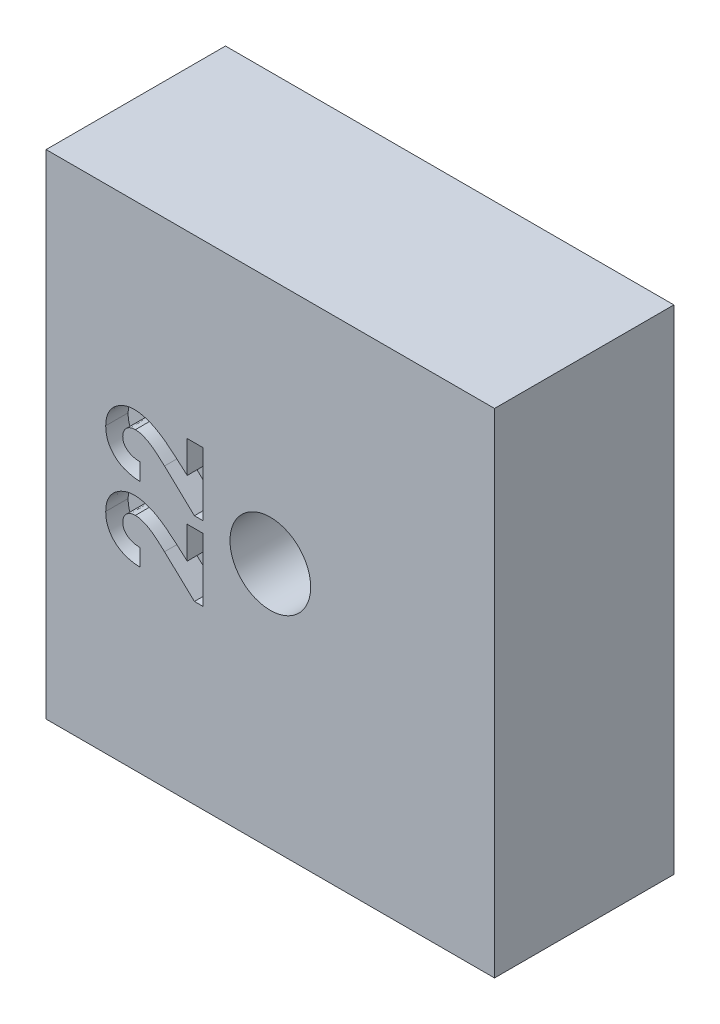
ISO-10303-21;
HEADER;
FILE_DESCRIPTION(('STEP AP214'),'2;1');
FILE_NAME('part.step','',(''),(''),'','','');
FILE_SCHEMA(('AUTOMOTIVE_DESIGN { 1 0 10303 214 1 1 1 1 }'));
ENDSEC;
DATA;
#1=APPLICATION_CONTEXT('core data for automotive mechanical design processes');
#2=APPLICATION_PROTOCOL_DEFINITION('international standard','automotive_design',2000,#1);
#3=PRODUCT_CONTEXT('',#1,'mechanical');
#4=PRODUCT('Part','Part','',(#3));
#5=PRODUCT_RELATED_PRODUCT_CATEGORY('part','',(#4));
#6=PRODUCT_DEFINITION_FORMATION('','',#4);
#7=PRODUCT_DEFINITION_CONTEXT('part definition',#1,'design');
#8=PRODUCT_DEFINITION('design','',#6,#7);
#9=PRODUCT_DEFINITION_SHAPE('','',#8);
#10=(LENGTH_UNIT() NAMED_UNIT(*) SI_UNIT(.MILLI.,.METRE.));
#11=(NAMED_UNIT(*) PLANE_ANGLE_UNIT() SI_UNIT($,.RADIAN.));
#12=(NAMED_UNIT(*) SI_UNIT($,.STERADIAN.) SOLID_ANGLE_UNIT());
#13=UNCERTAINTY_MEASURE_WITH_UNIT(LENGTH_MEASURE(1.E-05),#10,'distance_accuracy_value','');
#14=(GEOMETRIC_REPRESENTATION_CONTEXT(3) GLOBAL_UNCERTAINTY_ASSIGNED_CONTEXT((#13)) GLOBAL_UNIT_ASSIGNED_CONTEXT((#10,
#11,#12)) REPRESENTATION_CONTEXT('',''));
#15=CARTESIAN_POINT('',(0.,0.,0.));
#16=DIRECTION('',(0.,0.,1.));
#17=DIRECTION('',(1.,0.,0.));
#18=AXIS2_PLACEMENT_3D('',#15,#16,#17);
#19=CARTESIAN_POINT('',(0.,0.,8.));
#20=DIRECTION('',(0.,0.,1.));
#21=DIRECTION('',(1.,0.,0.));
#22=AXIS2_PLACEMENT_3D('',#19,#20,#21);
#23=PLANE('',#22);
#24=DIRECTION('',(0.,-1.,0.));
#25=VECTOR('',#24,1.);
#26=CARTESIAN_POINT('',(-12.2454183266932,15.0290836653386,8.));
#27=LINE('',#26,#25);
#28=CARTESIAN_POINT('',(-12.2454183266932,15.0290836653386,8.));
#29=VERTEX_POINT('',#28);
#30=CARTESIAN_POINT('',(-12.2454183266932,-6.97091633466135,8.));
#31=VERTEX_POINT('',#30);
#32=EDGE_CURVE('E324',#29,#31,#27,.T.);
#33=ORIENTED_EDGE('',*,*,#32,.T.);
#34=DIRECTION('',(1.,0.,0.));
#35=VECTOR('',#34,1.);
#36=CARTESIAN_POINT('',(-12.2454183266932,-6.97091633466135,8.));
#37=LINE('',#36,#35);
#38=CARTESIAN_POINT('',(7.75458167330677,-6.97091633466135,8.));
#39=VERTEX_POINT('',#38);
#40=EDGE_CURVE('E337',#31,#39,#37,.T.);
#41=ORIENTED_EDGE('',*,*,#40,.T.);
#42=DIRECTION('',(0.,1.,0.));
#43=VECTOR('',#42,1.);
#44=CARTESIAN_POINT('',(7.75458167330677,15.0290836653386,8.));
#45=LINE('',#44,#43);
#46=CARTESIAN_POINT('',(7.75458167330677,15.0290836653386,8.));
#47=VERTEX_POINT('',#46);
#48=EDGE_CURVE('E318',#39,#47,#45,.T.);
#49=ORIENTED_EDGE('',*,*,#48,.T.);
#50=DIRECTION('',(-1.,0.,0.));
#51=VECTOR('',#50,1.);
#52=CARTESIAN_POINT('',(-12.2454183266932,15.0290836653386,8.));
#53=LINE('',#52,#51);
#54=EDGE_CURVE('E331',#47,#29,#53,.T.);
#55=ORIENTED_EDGE('',*,*,#54,.T.);
#56=EDGE_LOOP('',(#33,#41,#49,#55));
#57=FACE_BOUND('',#56,.T.);
#58=CARTESIAN_POINT('',(-2.24541832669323,4.02908366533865,8.));
#59=DIRECTION('',(0.,0.,1.));
#60=DIRECTION('',(1.,0.,0.));
#61=AXIS2_PLACEMENT_3D('',#58,#59,#60);
#62=CIRCLE('',#61,1.8);
#63=CARTESIAN_POINT('',(-0.445418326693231,4.02908366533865,8.));
#64=VERTEX_POINT('',#63);
#65=EDGE_CURVE('E340',#64,#64,#62,.T.);
#66=ORIENTED_EDGE('',*,*,#65,.F.);
#67=EDGE_LOOP('',(#66));
#68=FACE_BOUND('',#67,.T.);
#69=CARTESIAN_POINT('',(-8.2643820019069,2.88934007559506,8.));
#70=CARTESIAN_POINT('',(-8.3036172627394,2.88786809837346,8.));
#71=CARTESIAN_POINT('',(-8.37964187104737,2.88501590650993,8.));
#72=CARTESIAN_POINT('',(-8.48778647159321,2.85367262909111,8.));
#73=CARTESIAN_POINT('',(-8.58570036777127,2.80511453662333,8.));
#74=CARTESIAN_POINT('',(-8.67045778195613,2.73668932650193,8.));
#75=CARTESIAN_POINT('',(-8.74010856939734,2.6538049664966,8.));
#76=CARTESIAN_POINT('',(-8.79191286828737,2.55802430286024,8.));
#77=CARTESIAN_POINT('',(-8.82180371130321,2.45012822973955,8.));
#78=CARTESIAN_POINT('',(-8.82554497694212,2.37449102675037,8.));
#79=CARTESIAN_POINT('',(-8.82746960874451,2.33558072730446,8.));
#80=B_SPLINE_CURVE_WITH_KNOTS('',3,(#69,#70,#71,#72,#73,#74,#75,#76,#77,#78,#79),.UNSPECIFIED.,
.F.,.F.,(4,1,1,1,1,1,1,1,4),(0.,0.132754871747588,0.257233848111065,0.378600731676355,
0.501406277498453,0.623941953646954,0.743641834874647,0.868120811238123,1.),.UNSPECIFIED.);
#81=CARTESIAN_POINT('',(-8.2643820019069,2.88934007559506,8.));
#82=VERTEX_POINT('',#81);
#83=CARTESIAN_POINT('',(-8.82746960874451,2.33558072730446,8.));
#84=VERTEX_POINT('',#83);
#85=EDGE_CURVE('E268',#82,#84,#80,.T.);
#86=ORIENTED_EDGE('',*,*,#85,.T.);
#87=CARTESIAN_POINT('',(-8.82746960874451,2.33558072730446,8.));
#88=CARTESIAN_POINT('',(-8.82675862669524,2.31547917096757,8.));
#89=CARTESIAN_POINT('',(-8.82535894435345,2.27590602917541,8.));
#90=CARTESIAN_POINT('',(-8.81604163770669,2.2177366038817,8.));
#91=CARTESIAN_POINT('',(-8.79962085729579,2.16238421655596,8.));
#92=CARTESIAN_POINT('',(-8.77761932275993,2.10923276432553,8.));
#93=CARTESIAN_POINT('',(-8.74845613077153,2.05884949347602,8.));
#94=CARTESIAN_POINT('',(-8.7125078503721,2.01136148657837,8.));
#95=CARTESIAN_POINT('',(-8.67068800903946,1.96626839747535,8.));
#96=CARTESIAN_POINT('',(-8.62312737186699,1.92377704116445,8.));
#97=CARTESIAN_POINT('',(-8.57004968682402,1.88510435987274,8.));
#98=CARTESIAN_POINT('',(-8.5119397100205,1.85075542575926,8.));
#99=CARTESIAN_POINT('',(-8.44883351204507,1.82235457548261,8.));
#100=CARTESIAN_POINT('',(-8.3815641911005,1.79734943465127,8.));
#101=CARTESIAN_POINT('',(-8.30940921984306,1.77806427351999,8.));
#102=CARTESIAN_POINT('',(-8.23280043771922,1.76402228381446,8.));
#103=CARTESIAN_POINT('',(-8.15186247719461,1.75334709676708,8.));
#104=CARTESIAN_POINT('',(-8.09622524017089,1.75086943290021,8.));
#105=CARTESIAN_POINT('',(-8.06764054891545,1.74959648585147,8.));
#106=B_SPLINE_CURVE_WITH_KNOTS('',3,(#87,#88,#89,#90,#91,#92,#93,#94,#95,#96,#97,#98,#99,#100,
#101,#102,#103,#104,#105),.UNSPECIFIED.,.F.,.F.,(4,1,1,1,1,1,1,1,1,1,1,1,1,1,1,1,4),(0.,
0.0564668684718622,0.111164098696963,0.164937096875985,0.218321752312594,0.272392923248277,
0.327976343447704,0.385291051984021,0.44490291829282,0.506843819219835,0.569488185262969,
0.634153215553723,0.700976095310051,0.770897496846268,0.843625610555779,0.919659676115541,1.),.UNSPECIFIED.);
#107=CARTESIAN_POINT('',(-8.06764054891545,1.74959648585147,8.));
#108=VERTEX_POINT('',#107);
#109=EDGE_CURVE('E56',#84,#108,#106,.T.);
#110=ORIENTED_EDGE('',*,*,#109,.T.);
#111=DIRECTION('',(0.,-1.,0.));
#112=VECTOR('',#111,1.);
#113=CARTESIAN_POINT('',(-8.06764054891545,1.74959648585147,8.));
#114=LINE('',#113,#112);
#115=CARTESIAN_POINT('',(-8.06764054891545,0.989767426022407,8.));
#116=VERTEX_POINT('',#115);
#117=EDGE_CURVE('E255',#108,#116,#114,.T.);
#118=ORIENTED_EDGE('',*,*,#117,.T.);
#119=CARTESIAN_POINT('',(-8.06764054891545,0.989767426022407,8.));
#120=CARTESIAN_POINT('',(-8.12511819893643,0.993047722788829,8.));
#121=CARTESIAN_POINT('',(-8.23742607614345,0.999457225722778,8.));
#122=CARTESIAN_POINT('',(-8.40054677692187,1.02498057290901,8.));
#123=CARTESIAN_POINT('',(-8.55471561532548,1.05909310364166,8.));
#124=CARTESIAN_POINT('',(-8.69946909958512,1.10500941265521,8.));
#125=CARTESIAN_POINT('',(-8.83486804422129,1.16156564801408,8.));
#126=CARTESIAN_POINT('',(-8.96046394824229,1.2301694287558,8.));
#127=CARTESIAN_POINT('',(-9.07715676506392,1.30877249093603,8.));
#128=CARTESIAN_POINT('',(-9.18289993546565,1.39895922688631,8.));
#129=CARTESIAN_POINT('',(-9.27796626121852,1.49706939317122,8.));
#130=CARTESIAN_POINT('',(-9.36107573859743,1.60285146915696,8.));
#131=CARTESIAN_POINT('',(-9.43064924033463,1.7160049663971,8.));
#132=CARTESIAN_POINT('',(-9.48772070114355,1.8357732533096,8.));
#133=CARTESIAN_POINT('',(-9.53338522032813,1.96168589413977,8.));
#134=CARTESIAN_POINT('',(-9.56389957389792,2.09501505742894,8.));
#135=CARTESIAN_POINT('',(-9.58456866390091,2.23458428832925,8.));
#136=CARTESIAN_POINT('',(-9.58637699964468,2.3301315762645,8.));
#137=CARTESIAN_POINT('',(-9.58729866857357,2.37882992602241,8.));
#138=B_SPLINE_CURVE_WITH_KNOTS('',3,(#119,#120,#121,#122,#123,#124,#125,#126,#127,#128,#129,
#130,#131,#132,#133,#134,#135,#136,#137),.UNSPECIFIED.,.F.,.F.,(4,1,1,1,1,1,1,1,1,1,1,1,1,1,1,1,
4),(0.,0.0749330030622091,0.146414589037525,0.214733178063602,0.280395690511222,
0.343911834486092,0.405520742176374,0.466476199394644,0.526809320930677,0.586167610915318,
0.644122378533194,0.701640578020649,0.758775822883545,0.81664635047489,0.875666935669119,
0.936630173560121,1.),.UNSPECIFIED.);
#139=CARTESIAN_POINT('',(-9.58729866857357,2.37882992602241,8.));
#140=VERTEX_POINT('',#139);
#141=EDGE_CURVE('E596',#116,#140,#138,.T.);
#142=ORIENTED_EDGE('',*,*,#141,.T.);
#143=CARTESIAN_POINT('',(-9.58729866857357,2.37882992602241,8.));
#144=CARTESIAN_POINT('',(-9.58555886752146,2.43863330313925,8.));
#145=CARTESIAN_POINT('',(-9.58216087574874,2.55543480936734,8.));
#146=CARTESIAN_POINT('',(-9.54934431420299,2.72459252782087,8.));
#147=CARTESIAN_POINT('',(-9.49909112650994,2.88342195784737,8.));
#148=CARTESIAN_POINT('',(-9.42608017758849,3.03023360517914,8.));
#149=CARTESIAN_POINT('',(-9.33401278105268,3.16477221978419,8.));
#150=CARTESIAN_POINT('',(-9.22402377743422,3.28628981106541,8.));
#151=CARTESIAN_POINT('',(-9.0947769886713,3.39241640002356,8.));
#152=CARTESIAN_POINT('',(-8.94999439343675,3.48232432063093,8.));
#153=CARTESIAN_POINT('',(-8.79638380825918,3.55667343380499,8.));
#154=CARTESIAN_POINT('',(-8.6378341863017,3.60927422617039,8.));
#155=CARTESIAN_POINT('',(-8.47843762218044,3.64366598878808,8.));
#156=CARTESIAN_POINT('',(-8.37112074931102,3.64734263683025,8.));
#157=CARTESIAN_POINT('',(-8.31780748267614,3.64916913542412,8.));
#158=B_SPLINE_CURVE_WITH_KNOTS('',3,(#143,#144,#145,#146,#147,#148,#149,#150,#151,#152,#153,
#154,#155,#156,#157),.UNSPECIFIED.,.F.,.F.,(4,1,1,1,1,1,1,1,1,1,1,1,4),(0.,0.08961451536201,
0.175025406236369,0.257493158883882,0.338845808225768,0.419998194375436,0.501346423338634,
0.583869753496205,0.669988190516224,0.756473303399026,0.839206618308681,0.920120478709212,1.),.UNSPECIFIED.);
#159=CARTESIAN_POINT('',(-8.31780748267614,3.64916913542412,8.));
#160=VERTEX_POINT('',#159);
#161=EDGE_CURVE('E601',#140,#160,#158,.T.);
#162=ORIENTED_EDGE('',*,*,#161,.T.);
#163=CARTESIAN_POINT('',(-8.31780748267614,3.64916913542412,8.));
#164=CARTESIAN_POINT('',(-8.2855592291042,3.64845890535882,8.));
#165=CARTESIAN_POINT('',(-8.22065146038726,3.64702938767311,8.));
#166=CARTESIAN_POINT('',(-8.12243007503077,3.63708976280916,8.));
#167=CARTESIAN_POINT('',(-8.02238011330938,3.62217835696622,8.));
#168=CARTESIAN_POINT('',(-7.92058734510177,3.59969560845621,8.));
#169=CARTESIAN_POINT('',(-7.81702328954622,3.57165771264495,8.));
#170=CARTESIAN_POINT('',(-7.71137780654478,3.53764394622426,8.));
#171=CARTESIAN_POINT('',(-7.60425068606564,3.49686412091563,8.));
#172=CARTESIAN_POINT('',(-7.49443300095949,3.4500034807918,8.));
#173=CARTESIAN_POINT('',(-7.38158116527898,3.39408283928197,8.));
#174=CARTESIAN_POINT('',(-7.26395007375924,3.32903591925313,8.));
#175=CARTESIAN_POINT('',(-7.14166495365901,3.25268805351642,8.));
#176=CARTESIAN_POINT('',(-7.0135263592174,3.16752459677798,8.));
#177=CARTESIAN_POINT('',(-6.8814908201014,3.0701951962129,8.));
#178=CARTESIAN_POINT('',(-6.74409218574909,2.96327801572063,8.));
#179=CARTESIAN_POINT('',(-6.60154695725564,2.84623486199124,8.));
#180=CARTESIAN_POINT('',(-6.50622030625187,2.76322945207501,8.));
#181=CARTESIAN_POINT('',(-6.45724391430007,2.72058339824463,8.));
#182=B_SPLINE_CURVE_WITH_KNOTS('',3,(#163,#164,#165,#166,#167,#168,#169,#170,#171,#172,#173,
#174,#175,#176,#177,#178,#179,#180,#181),.UNSPECIFIED.,.F.,.F.,(4,1,1,1,1,1,1,1,1,1,1,1,1,1,1,1,
4),(0.,0.0455173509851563,0.0916151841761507,0.139245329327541,0.188239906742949,
0.238670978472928,0.290661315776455,0.344836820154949,0.400428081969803,0.459139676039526,
0.522546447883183,0.590095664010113,0.662585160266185,0.73968359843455,0.821577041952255,
0.908330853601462,1.),.UNSPECIFIED.);
#183=CARTESIAN_POINT('',(-6.45724391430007,2.72058339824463,8.));
#184=VERTEX_POINT('',#183);
#185=EDGE_CURVE('E609',#160,#184,#182,.T.);
#186=ORIENTED_EDGE('',*,*,#185,.T.);
#187=DIRECTION('',(0.753436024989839,-0.657521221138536,0.));
#188=VECTOR('',#187,1.);
#189=CARTESIAN_POINT('',(-6.45724391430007,2.72058339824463,8.));
#190=LINE('',#189,#188);
#191=CARTESIAN_POINT('',(-5.95097388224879,2.27876315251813,8.));
#192=VERTEX_POINT('',#191);
#193=EDGE_CURVE('E617',#184,#192,#190,.T.);
#194=ORIENTED_EDGE('',*,*,#193,.T.);
#195=DIRECTION('',(0.,1.,0.));
#196=VECTOR('',#195,1.);
#197=CARTESIAN_POINT('',(-5.95097388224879,2.27876315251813,8.));
#198=LINE('',#197,#196);
#199=CARTESIAN_POINT('',(-5.95097388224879,3.70344263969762,8.));
#200=VERTEX_POINT('',#199);
#201=EDGE_CURVE('E623',#192,#200,#198,.T.);
#202=ORIENTED_EDGE('',*,*,#201,.T.);
#203=DIRECTION('',(1.,0.,0.));
#204=VECTOR('',#203,1.);
#205=CARTESIAN_POINT('',(-5.95097388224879,3.70344263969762,8.));
#206=LINE('',#205,#204);
#207=CARTESIAN_POINT('',(-5.24541832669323,3.70344263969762,8.));
#208=VERTEX_POINT('',#207);
#209=EDGE_CURVE('E626',#200,#208,#206,.T.);
#210=ORIENTED_EDGE('',*,*,#209,.T.);
#211=DIRECTION('',(0.,-1.,0.));
#212=VECTOR('',#211,1.);
#213=CARTESIAN_POINT('',(-5.24541832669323,3.70344263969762,8.));
#214=LINE('',#213,#212);
#215=CARTESIAN_POINT('',(-5.24541832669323,0.881220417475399,8.));
#216=VERTEX_POINT('',#215);
#217=EDGE_CURVE('E629',#208,#216,#214,.T.);
#218=ORIENTED_EDGE('',*,*,#217,.T.);
#219=DIRECTION('',(-1.,0.,0.));
#220=VECTOR('',#219,1.);
#221=CARTESIAN_POINT('',(-5.24541832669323,0.881220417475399,8.));
#222=LINE('',#221,#220);
#223=CARTESIAN_POINT('',(-5.6304209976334,0.881220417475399,8.));
#224=VERTEX_POINT('',#223);
#225=EDGE_CURVE('E632',#216,#224,#222,.T.);
#226=ORIENTED_EDGE('',*,*,#225,.T.);
#227=DIRECTION('',(-0.728771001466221,0.684757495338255,0.));
#228=VECTOR('',#227,1.);
#229=CARTESIAN_POINT('',(-5.6304209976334,0.881220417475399,8.));
#230=LINE('',#229,#228);
#231=CARTESIAN_POINT('',(-6.96436196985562,2.13459915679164,8.));
#232=VERTEX_POINT('',#231);
#233=EDGE_CURVE('E635',#224,#232,#230,.T.);
#234=ORIENTED_EDGE('',*,*,#233,.T.);
#235=CARTESIAN_POINT('',(-6.96436196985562,2.13459915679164,8.));
#236=CARTESIAN_POINT('',(-7.0032730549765,2.17088826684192,8.));
#237=CARTESIAN_POINT('',(-7.07863228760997,2.24116951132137,8.));
#238=CARTESIAN_POINT('',(-7.18931166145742,2.34116314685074,8.));
#239=CARTESIAN_POINT('',(-7.29432107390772,2.43168185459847,8.));
#240=CARTESIAN_POINT('',(-7.39487828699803,2.51070164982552,8.));
#241=CARTESIAN_POINT('',(-7.48757856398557,2.5830034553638,8.));
#242=CARTESIAN_POINT('',(-7.5759263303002,2.64348923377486,8.));
#243=CARTESIAN_POINT('',(-7.65743355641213,2.69616493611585,8.));
#244=CARTESIAN_POINT('',(-7.75678762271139,2.75119027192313,8.));
#245=CARTESIAN_POINT('',(-7.87439004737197,2.8046488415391,8.));
#246=CARTESIAN_POINT('',(-8.00978912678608,2.85366949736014,8.));
#247=CARTESIAN_POINT('',(-8.13929020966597,2.88325144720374,8.));
#248=CARTESIAN_POINT('',(-8.22382697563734,2.88736612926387,8.));
#249=CARTESIAN_POINT('',(-8.2643820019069,2.88934007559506,8.));
#250=B_SPLINE_CURVE_WITH_KNOTS('',3,(#235,#236,#237,#238,#239,#240,#241,#242,#243,#244,#245,
#246,#247,#248,#249),.UNSPECIFIED.,.F.,.F.,(4,1,1,1,1,1,1,1,1,1,1,1,4),(0.,0.103849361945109,
0.201125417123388,0.29113096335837,0.374368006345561,0.450730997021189,0.520520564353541,
0.583275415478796,0.640080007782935,0.742043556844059,0.835051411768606,0.920868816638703,1.),.UNSPECIFIED.);
#251=EDGE_CURVE('E638',#232,#82,#250,.T.);
#252=ORIENTED_EDGE('',*,*,#251,.T.);
#253=EDGE_LOOP('',(#86,#110,#118,#142,#162,#186,#194,#202,#210,#218,#226,#234,#252));
#254=FACE_BOUND('',#253,.T.);
#255=CARTESIAN_POINT('',(-8.2643820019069,6.20002383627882,8.));
#256=CARTESIAN_POINT('',(-8.3036172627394,6.19855185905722,8.));
#257=CARTESIAN_POINT('',(-8.37964187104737,6.19569966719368,8.));
#258=CARTESIAN_POINT('',(-8.48778647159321,6.16435638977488,8.));
#259=CARTESIAN_POINT('',(-8.58570036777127,6.11579829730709,8.));
#260=CARTESIAN_POINT('',(-8.67045778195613,6.04737308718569,8.));
#261=CARTESIAN_POINT('',(-8.74010856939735,5.96448872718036,8.));
#262=CARTESIAN_POINT('',(-8.79191286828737,5.868708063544,8.));
#263=CARTESIAN_POINT('',(-8.82180371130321,5.76081199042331,8.));
#264=CARTESIAN_POINT('',(-8.82554497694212,5.68517478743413,8.));
#265=CARTESIAN_POINT('',(-8.82746960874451,5.64626448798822,8.));
#266=B_SPLINE_CURVE_WITH_KNOTS('',3,(#255,#256,#257,#258,#259,#260,#261,#262,#263,#264,#265),
.UNSPECIFIED.,.F.,.F.,(4,1,1,1,1,1,1,1,4),(0.,0.132754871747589,0.257233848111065,
0.378600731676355,0.501406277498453,0.623941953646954,0.743641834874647,0.868120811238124,1.),.UNSPECIFIED.);
#267=CARTESIAN_POINT('',(-8.2643820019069,6.20002383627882,8.));
#268=VERTEX_POINT('',#267);
#269=CARTESIAN_POINT('',(-8.82746960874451,5.64626448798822,8.));
#270=VERTEX_POINT('',#269);
#271=EDGE_CURVE('E248',#268,#270,#266,.T.);
#272=ORIENTED_EDGE('',*,*,#271,.T.);
#273=CARTESIAN_POINT('',(-8.82746960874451,5.64626448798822,8.));
#274=CARTESIAN_POINT('',(-8.82675862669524,5.62616293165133,8.));
#275=CARTESIAN_POINT('',(-8.82535894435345,5.58658978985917,8.));
#276=CARTESIAN_POINT('',(-8.81604163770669,5.52842036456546,8.00000000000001));
#277=CARTESIAN_POINT('',(-8.79962085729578,5.47306797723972,8.));
#278=CARTESIAN_POINT('',(-8.77761932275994,5.41991652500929,8.));
#279=CARTESIAN_POINT('',(-8.74845613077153,5.36953325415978,8.));
#280=CARTESIAN_POINT('',(-8.7125078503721,5.32204524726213,8.));
#281=CARTESIAN_POINT('',(-8.67068800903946,5.27695215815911,8.));
#282=CARTESIAN_POINT('',(-8.623127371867,5.23446080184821,8.));
#283=CARTESIAN_POINT('',(-8.57004968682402,5.1957881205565,8.));
#284=CARTESIAN_POINT('',(-8.5119397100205,5.16143918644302,8.));
#285=CARTESIAN_POINT('',(-8.44883351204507,5.13303833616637,8.));
#286=CARTESIAN_POINT('',(-8.3815641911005,5.10803319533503,8.));
#287=CARTESIAN_POINT('',(-8.30940921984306,5.08874803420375,8.));
#288=CARTESIAN_POINT('',(-8.23280043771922,5.07470604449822,8.));
#289=CARTESIAN_POINT('',(-8.15186247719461,5.06403085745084,8.));
#290=CARTESIAN_POINT('',(-8.0962252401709,5.06155319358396,8.));
#291=CARTESIAN_POINT('',(-8.06764054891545,5.06028024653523,8.));
#292=B_SPLINE_CURVE_WITH_KNOTS('',3,(#273,#274,#275,#276,#277,#278,#279,#280,#281,#282,#283,
#284,#285,#286,#287,#288,#289,#290,#291),.UNSPECIFIED.,.F.,.F.,(4,1,1,1,1,1,1,1,1,1,1,1,1,1,1,1,
4),(0.,0.056466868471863,0.111164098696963,0.164937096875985,0.218321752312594,
0.272392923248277,0.327976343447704,0.385291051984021,0.44490291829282,0.506843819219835,
0.569488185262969,0.634153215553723,0.700976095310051,0.770897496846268,0.843625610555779,
0.919659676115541,1.),.UNSPECIFIED.);
#293=CARTESIAN_POINT('',(-8.06764054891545,5.06028024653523,8.));
#294=VERTEX_POINT('',#293);
#295=EDGE_CURVE('E48',#270,#294,#292,.T.);
#296=ORIENTED_EDGE('',*,*,#295,.T.);
#297=DIRECTION('',(0.,-1.,0.));
#298=VECTOR('',#297,1.);
#299=CARTESIAN_POINT('',(-8.06764054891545,5.06028024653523,8.));
#300=LINE('',#299,#298);
#301=CARTESIAN_POINT('',(-8.06764054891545,4.30045118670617,8.));
#302=VERTEX_POINT('',#301);
#303=EDGE_CURVE('E252',#294,#302,#300,.T.);
#304=ORIENTED_EDGE('',*,*,#303,.T.);
#305=CARTESIAN_POINT('',(-8.06764054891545,4.30045118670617,8.));
#306=CARTESIAN_POINT('',(-8.12511819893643,4.30373148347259,8.));
#307=CARTESIAN_POINT('',(-8.23742607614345,4.31014098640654,8.));
#308=CARTESIAN_POINT('',(-8.40054677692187,4.33566433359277,8.));
#309=CARTESIAN_POINT('',(-8.55471561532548,4.36977686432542,8.));
#310=CARTESIAN_POINT('',(-8.69946909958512,4.41569317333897,8.));
#311=CARTESIAN_POINT('',(-8.83486804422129,4.47224940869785,8.));
#312=CARTESIAN_POINT('',(-8.96046394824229,4.54085318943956,8.));
#313=CARTESIAN_POINT('',(-9.07715676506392,4.6194562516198,8.));
#314=CARTESIAN_POINT('',(-9.18289993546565,4.70964298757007,8.));
#315=CARTESIAN_POINT('',(-9.27796626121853,4.80775315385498,8.));
#316=CARTESIAN_POINT('',(-9.36107573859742,4.91353522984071,8.));
#317=CARTESIAN_POINT('',(-9.43064924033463,5.02668872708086,8.));
#318=CARTESIAN_POINT('',(-9.48772070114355,5.14645701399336,8.));
#319=CARTESIAN_POINT('',(-9.53338522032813,5.27236965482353,8.));
#320=CARTESIAN_POINT('',(-9.56389957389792,5.4056988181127,8.));
#321=CARTESIAN_POINT('',(-9.58456866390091,5.54526804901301,8.));
#322=CARTESIAN_POINT('',(-9.58637699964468,5.64081533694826,8.));
#323=CARTESIAN_POINT('',(-9.58729866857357,5.68951368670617,8.));
#324=B_SPLINE_CURVE_WITH_KNOTS('',3,(#305,#306,#307,#308,#309,#310,#311,#312,#313,#314,#315,
#316,#317,#318,#319,#320,#321,#322,#323),.UNSPECIFIED.,.F.,.F.,(4,1,1,1,1,1,1,1,1,1,1,1,1,1,1,1,
4),(0.,0.0749330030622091,0.146414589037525,0.214733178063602,0.280395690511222,
0.343911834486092,0.405520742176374,0.466476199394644,0.526809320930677,0.586167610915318,
0.644122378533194,0.701640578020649,0.758775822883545,0.81664635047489,0.875666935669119,
0.936630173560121,1.),.UNSPECIFIED.);
#325=CARTESIAN_POINT('',(-9.58729866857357,5.68951368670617,8.));
#326=VERTEX_POINT('',#325);
#327=EDGE_CURVE('E402',#302,#326,#324,.T.);
#328=ORIENTED_EDGE('',*,*,#327,.T.);
#329=CARTESIAN_POINT('',(-9.58729866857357,5.68951368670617,8.));
#330=CARTESIAN_POINT('',(-9.58555886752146,5.74931706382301,8.));
#331=CARTESIAN_POINT('',(-9.58216087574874,5.8661185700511,8.));
#332=CARTESIAN_POINT('',(-9.54934431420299,6.03527628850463,8.));
#333=CARTESIAN_POINT('',(-9.49909112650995,6.19410571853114,8.));
#334=CARTESIAN_POINT('',(-9.42608017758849,6.3409173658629,8.));
#335=CARTESIAN_POINT('',(-9.33401278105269,6.47545598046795,8.));
#336=CARTESIAN_POINT('',(-9.22402377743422,6.59697357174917,8.));
#337=CARTESIAN_POINT('',(-9.0947769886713,6.70310016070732,8.));
#338=CARTESIAN_POINT('',(-8.94999439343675,6.79300808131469,8.));
#339=CARTESIAN_POINT('',(-8.79638380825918,6.86735719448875,8.));
#340=CARTESIAN_POINT('',(-8.6378341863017,6.91995798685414,8.));
#341=CARTESIAN_POINT('',(-8.47843762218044,6.95434974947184,8.));
#342=CARTESIAN_POINT('',(-8.37112074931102,6.95802639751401,8.));
#343=CARTESIAN_POINT('',(-8.31780748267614,6.95985289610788,8.));
#344=B_SPLINE_CURVE_WITH_KNOTS('',3,(#329,#330,#331,#332,#333,#334,#335,#336,#337,#338,#339,
#340,#341,#342,#343),.UNSPECIFIED.,.F.,.F.,(4,1,1,1,1,1,1,1,1,1,1,1,4),(0.,0.0896145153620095,
0.175025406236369,0.257493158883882,0.338845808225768,0.419998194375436,0.501346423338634,
0.583869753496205,0.669988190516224,0.756473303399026,0.839206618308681,0.920120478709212,1.),.UNSPECIFIED.);
#345=CARTESIAN_POINT('',(-8.31780748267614,6.95985289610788,8.));
#346=VERTEX_POINT('',#345);
#347=EDGE_CURVE('E405',#326,#346,#344,.T.);
#348=ORIENTED_EDGE('',*,*,#347,.T.);
#349=CARTESIAN_POINT('',(-8.31780748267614,6.95985289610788,8.));
#350=CARTESIAN_POINT('',(-8.2855592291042,6.95914266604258,8.));
#351=CARTESIAN_POINT('',(-8.22065146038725,6.95771314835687,8.));
#352=CARTESIAN_POINT('',(-8.12243007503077,6.94777352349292,8.));
#353=CARTESIAN_POINT('',(-8.02238011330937,6.93286211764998,8.));
#354=CARTESIAN_POINT('',(-7.92058734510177,6.91037936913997,8.));
#355=CARTESIAN_POINT('',(-7.81702328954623,6.88234147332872,8.));
#356=CARTESIAN_POINT('',(-7.71137780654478,6.84832770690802,8.));
#357=CARTESIAN_POINT('',(-7.60425068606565,6.80754788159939,8.));
#358=CARTESIAN_POINT('',(-7.49443300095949,6.76068724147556,8.));
#359=CARTESIAN_POINT('',(-7.38158116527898,6.70476659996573,8.));
#360=CARTESIAN_POINT('',(-7.26395007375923,6.63971967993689,8.));
#361=CARTESIAN_POINT('',(-7.14166495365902,6.56337181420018,8.));
#362=CARTESIAN_POINT('',(-7.0135263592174,6.47820835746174,8.));
#363=CARTESIAN_POINT('',(-6.8814908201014,6.38087895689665,8.));
#364=CARTESIAN_POINT('',(-6.74409218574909,6.27396177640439,8.));
#365=CARTESIAN_POINT('',(-6.60154695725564,6.156918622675,8.));
#366=CARTESIAN_POINT('',(-6.50622030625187,6.07391321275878,8.));
#367=CARTESIAN_POINT('',(-6.45724391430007,6.03126715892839,8.));
#368=B_SPLINE_CURVE_WITH_KNOTS('',3,(#349,#350,#351,#352,#353,#354,#355,#356,#357,#358,#359,
#360,#361,#362,#363,#364,#365,#366,#367),.UNSPECIFIED.,.F.,.F.,(4,1,1,1,1,1,1,1,1,1,1,1,1,1,1,1,
4),(0.,0.0455173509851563,0.0916151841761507,0.139245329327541,0.188239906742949,
0.238670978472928,0.290661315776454,0.344836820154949,0.400428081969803,0.459139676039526,
0.522546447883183,0.590095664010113,0.662585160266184,0.73968359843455,0.821577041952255,
0.908330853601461,1.),.UNSPECIFIED.);
#369=CARTESIAN_POINT('',(-6.45724391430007,6.03126715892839,8.));
#370=VERTEX_POINT('',#369);
#371=EDGE_CURVE('E410',#346,#370,#368,.T.);
#372=ORIENTED_EDGE('',*,*,#371,.T.);
#373=DIRECTION('',(0.753436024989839,-0.657521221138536,0.));
#374=VECTOR('',#373,1.);
#375=CARTESIAN_POINT('',(-6.45724391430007,6.03126715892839,8.));
#376=LINE('',#375,#374);
#377=CARTESIAN_POINT('',(-5.95097388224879,5.58944691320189,8.));
#378=VERTEX_POINT('',#377);
#379=EDGE_CURVE('E429',#370,#378,#376,.T.);
#380=ORIENTED_EDGE('',*,*,#379,.T.);
#381=DIRECTION('',(0.,1.,0.));
#382=VECTOR('',#381,1.);
#383=CARTESIAN_POINT('',(-5.95097388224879,5.58944691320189,8.));
#384=LINE('',#383,#382);
#385=CARTESIAN_POINT('',(-5.95097388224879,7.01412640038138,8.));
#386=VERTEX_POINT('',#385);
#387=EDGE_CURVE('E435',#378,#386,#384,.T.);
#388=ORIENTED_EDGE('',*,*,#387,.T.);
#389=DIRECTION('',(1.,0.,0.));
#390=VECTOR('',#389,1.);
#391=CARTESIAN_POINT('',(-5.95097388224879,7.01412640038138,8.));
#392=LINE('',#391,#390);
#393=CARTESIAN_POINT('',(-5.24541832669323,7.01412640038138,8.));
#394=VERTEX_POINT('',#393);
#395=EDGE_CURVE('E438',#386,#394,#392,.T.);
#396=ORIENTED_EDGE('',*,*,#395,.T.);
#397=DIRECTION('',(0.,-1.,0.));
#398=VECTOR('',#397,1.);
#399=CARTESIAN_POINT('',(-5.24541832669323,7.01412640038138,8.));
#400=LINE('',#399,#398);
#401=CARTESIAN_POINT('',(-5.24541832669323,4.19190417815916,8.));
#402=VERTEX_POINT('',#401);
#403=EDGE_CURVE('E441',#394,#402,#400,.T.);
#404=ORIENTED_EDGE('',*,*,#403,.T.);
#405=DIRECTION('',(-1.,0.,0.));
#406=VECTOR('',#405,1.);
#407=CARTESIAN_POINT('',(-5.24541832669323,4.19190417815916,8.));
#408=LINE('',#407,#406);
#409=CARTESIAN_POINT('',(-5.6304209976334,4.19190417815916,8.));
#410=VERTEX_POINT('',#409);
#411=EDGE_CURVE('E444',#402,#410,#408,.T.);
#412=ORIENTED_EDGE('',*,*,#411,.T.);
#413=DIRECTION('',(-0.728771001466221,0.684757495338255,0.));
#414=VECTOR('',#413,1.);
#415=CARTESIAN_POINT('',(-5.6304209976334,4.19190417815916,8.));
#416=LINE('',#415,#414);
#417=CARTESIAN_POINT('',(-6.96436196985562,5.4452829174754,8.));
#418=VERTEX_POINT('',#417);
#419=EDGE_CURVE('E366',#410,#418,#416,.T.);
#420=ORIENTED_EDGE('',*,*,#419,.T.);
#421=CARTESIAN_POINT('',(-6.96436196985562,5.4452829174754,8.));
#422=CARTESIAN_POINT('',(-7.0032730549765,5.48157202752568,8.));
#423=CARTESIAN_POINT('',(-7.07863228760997,5.55185327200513,8.));
#424=CARTESIAN_POINT('',(-7.18931166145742,5.6518469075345,8.));
#425=CARTESIAN_POINT('',(-7.29432107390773,5.74236561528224,8.));
#426=CARTESIAN_POINT('',(-7.39487828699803,5.82138541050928,8.));
#427=CARTESIAN_POINT('',(-7.48757856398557,5.89368721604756,8.));
#428=CARTESIAN_POINT('',(-7.5759263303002,5.95417299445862,8.));
#429=CARTESIAN_POINT('',(-7.65743355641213,6.00684869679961,8.));
#430=CARTESIAN_POINT('',(-7.7567876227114,6.06187403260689,8.));
#431=CARTESIAN_POINT('',(-7.87439004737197,6.11533260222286,8.));
#432=CARTESIAN_POINT('',(-8.00978912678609,6.16435325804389,8.));
#433=CARTESIAN_POINT('',(-8.13929020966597,6.1939352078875,8.));
#434=CARTESIAN_POINT('',(-8.22382697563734,6.19804988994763,8.));
#435=CARTESIAN_POINT('',(-8.2643820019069,6.20002383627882,8.));
#436=B_SPLINE_CURVE_WITH_KNOTS('',3,(#421,#422,#423,#424,#425,#426,#427,#428,#429,#430,#431,
#432,#433,#434,#435),.UNSPECIFIED.,.F.,.F.,(4,1,1,1,1,1,1,1,1,1,1,1,4),(0.,0.103849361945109,
0.201125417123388,0.29113096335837,0.374368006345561,0.450730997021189,0.520520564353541,
0.583275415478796,0.640080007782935,0.742043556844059,0.835051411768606,0.920868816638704,1.),.UNSPECIFIED.);
#437=EDGE_CURVE('E362',#418,#268,#436,.T.);
#438=ORIENTED_EDGE('',*,*,#437,.T.);
#439=EDGE_LOOP('',(#272,#296,#304,#328,#348,#372,#380,#388,#396,#404,#412,#420,#438));
#440=FACE_BOUND('',#439,.T.);
#441=ADVANCED_FACE('F33',(#57,#68,#254,#440),#23,.T.);
#442=CARTESIAN_POINT('',(0.,0.,0.));
#443=DIRECTION('',(0.,0.,1.));
#444=DIRECTION('',(1.,0.,0.));
#445=AXIS2_PLACEMENT_3D('',#442,#443,#444);
#446=PLANE('',#445);
#447=DIRECTION('',(0.,-1.,0.));
#448=VECTOR('',#447,1.);
#449=CARTESIAN_POINT('',(-12.2454183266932,15.0290836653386,0.));
#450=LINE('',#449,#448);
#451=CARTESIAN_POINT('',(-12.2454183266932,15.0290836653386,0.));
#452=VERTEX_POINT('',#451);
#453=CARTESIAN_POINT('',(-12.2454183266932,-6.97091633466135,0.));
#454=VERTEX_POINT('',#453);
#455=EDGE_CURVE('E314',#452,#454,#450,.T.);
#456=ORIENTED_EDGE('',*,*,#455,.F.);
#457=DIRECTION('',(-1.,0.,0.));
#458=VECTOR('',#457,1.);
#459=CARTESIAN_POINT('',(-12.2454183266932,15.0290836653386,0.));
#460=LINE('',#459,#458);
#461=CARTESIAN_POINT('',(7.75458167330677,15.0290836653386,0.));
#462=VERTEX_POINT('',#461);
#463=EDGE_CURVE('E322',#462,#452,#460,.T.);
#464=ORIENTED_EDGE('',*,*,#463,.F.);
#465=DIRECTION('',(0.,1.,0.));
#466=VECTOR('',#465,1.);
#467=CARTESIAN_POINT('',(7.75458167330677,15.0290836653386,0.));
#468=LINE('',#467,#466);
#469=CARTESIAN_POINT('',(7.75458167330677,-6.97091633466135,0.));
#470=VERTEX_POINT('',#469);
#471=EDGE_CURVE('E313',#470,#462,#468,.T.);
#472=ORIENTED_EDGE('',*,*,#471,.F.);
#473=DIRECTION('',(1.,0.,0.));
#474=VECTOR('',#473,1.);
#475=CARTESIAN_POINT('',(-12.2454183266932,-6.97091633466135,0.));
#476=LINE('',#475,#474);
#477=EDGE_CURVE('E306',#454,#470,#476,.T.);
#478=ORIENTED_EDGE('',*,*,#477,.F.);
#479=EDGE_LOOP('',(#456,#464,#472,#478));
#480=FACE_BOUND('',#479,.T.);
#481=CARTESIAN_POINT('',(-2.24541832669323,4.02908366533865,0.));
#482=DIRECTION('',(0.,0.,1.));
#483=DIRECTION('',(1.,0.,0.));
#484=AXIS2_PLACEMENT_3D('',#481,#482,#483);
#485=CIRCLE('',#484,1.8);
#486=CARTESIAN_POINT('',(-0.445418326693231,4.02908366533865,0.));
#487=VERTEX_POINT('',#486);
#488=EDGE_CURVE('E342',#487,#487,#485,.T.);
#489=ORIENTED_EDGE('',*,*,#488,.T.);
#490=EDGE_LOOP('',(#489));
#491=FACE_BOUND('',#490,.T.);
#492=ADVANCED_FACE('F287',(#480,#491),#446,.F.);
#493=CARTESIAN_POINT('',(-12.2454183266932,15.0290836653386,8.));
#494=DIRECTION('',(1.,0.,0.));
#495=DIRECTION('',(0.,1.,0.));
#496=AXIS2_PLACEMENT_3D('',#493,#494,#495);
#497=PLANE('',#496);
#498=ORIENTED_EDGE('',*,*,#455,.T.);
#499=DIRECTION('',(0.,0.,-1.));
#500=VECTOR('',#499,1.);
#501=CARTESIAN_POINT('',(-12.2454183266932,-6.97091633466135,8.));
#502=LINE('',#501,#500);
#503=EDGE_CURVE('E11',#31,#454,#502,.T.);
#504=ORIENTED_EDGE('',*,*,#503,.F.);
#505=ORIENTED_EDGE('',*,*,#32,.F.);
#506=DIRECTION('',(0.,0.,-1.));
#507=VECTOR('',#506,1.);
#508=CARTESIAN_POINT('',(-12.2454183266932,15.0290836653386,8.));
#509=LINE('',#508,#507);
#510=EDGE_CURVE('E328',#29,#452,#509,.T.);
#511=ORIENTED_EDGE('',*,*,#510,.T.);
#512=EDGE_LOOP('',(#498,#504,#505,#511));
#513=FACE_BOUND('',#512,.T.);
#514=ADVANCED_FACE('F35',(#513),#497,.F.);
#515=CARTESIAN_POINT('',(-12.2454183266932,-6.97091633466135,8.));
#516=DIRECTION('',(0.,1.,0.));
#517=DIRECTION('',(0.,0.,1.));
#518=AXIS2_PLACEMENT_3D('',#515,#516,#517);
#519=PLANE('',#518);
#520=ORIENTED_EDGE('',*,*,#477,.T.);
#521=DIRECTION('',(0.,0.,-1.));
#522=VECTOR('',#521,1.);
#523=CARTESIAN_POINT('',(7.75458167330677,-6.97091633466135,8.));
#524=LINE('',#523,#522);
#525=EDGE_CURVE('E41',#39,#470,#524,.T.);
#526=ORIENTED_EDGE('',*,*,#525,.F.);
#527=ORIENTED_EDGE('',*,*,#40,.F.);
#528=ORIENTED_EDGE('',*,*,#503,.T.);
#529=EDGE_LOOP('',(#520,#526,#527,#528));
#530=FACE_BOUND('',#529,.T.);
#531=ADVANCED_FACE('F297',(#530),#519,.F.);
#532=CARTESIAN_POINT('',(7.75458167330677,15.0290836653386,8.));
#533=DIRECTION('',(-1.,0.,0.));
#534=DIRECTION('',(0.,-1.,0.));
#535=AXIS2_PLACEMENT_3D('',#532,#533,#534);
#536=PLANE('',#535);
#537=ORIENTED_EDGE('',*,*,#471,.T.);
#538=DIRECTION('',(0.,0.,-1.));
#539=VECTOR('',#538,1.);
#540=CARTESIAN_POINT('',(7.75458167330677,15.0290836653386,8.));
#541=LINE('',#540,#539);
#542=EDGE_CURVE('E319',#47,#462,#541,.T.);
#543=ORIENTED_EDGE('',*,*,#542,.F.);
#544=ORIENTED_EDGE('',*,*,#48,.F.);
#545=ORIENTED_EDGE('',*,*,#525,.T.);
#546=EDGE_LOOP('',(#537,#543,#544,#545));
#547=FACE_BOUND('',#546,.T.);
#548=ADVANCED_FACE('F294',(#547),#536,.F.);
#549=CARTESIAN_POINT('',(-12.2454183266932,15.0290836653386,8.));
#550=DIRECTION('',(0.,-1.,0.));
#551=DIRECTION('',(0.,0.,-1.));
#552=AXIS2_PLACEMENT_3D('',#549,#550,#551);
#553=PLANE('',#552);
#554=ORIENTED_EDGE('',*,*,#463,.T.);
#555=ORIENTED_EDGE('',*,*,#510,.F.);
#556=ORIENTED_EDGE('',*,*,#54,.F.);
#557=ORIENTED_EDGE('',*,*,#542,.T.);
#558=EDGE_LOOP('',(#554,#555,#556,#557));
#559=FACE_BOUND('',#558,.T.);
#560=ADVANCED_FACE('F283',(#559),#553,.F.);
#561=CARTESIAN_POINT('',(-2.24541832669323,4.02908366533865,8.));
#562=DIRECTION('',(0.,0.,-1.));
#563=DIRECTION('',(-1.,0.,0.));
#564=AXIS2_PLACEMENT_3D('',#561,#562,#563);
#565=CYLINDRICAL_SURFACE('',#564,1.8);
#566=ORIENTED_EDGE('',*,*,#65,.T.);
#567=EDGE_LOOP('',(#566));
#568=FACE_BOUND('',#567,.T.);
#569=ORIENTED_EDGE('',*,*,#488,.F.);
#570=EDGE_LOOP('',(#569));
#571=FACE_BOUND('',#570,.T.);
#572=ADVANCED_FACE('F279',(#568,#571),#565,.F.);
#573=CARTESIAN_POINT('',(-8.82746960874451,2.33558072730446,7.));
#574=CARTESIAN_POINT('',(-8.82675862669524,2.31547917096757,7.));
#575=CARTESIAN_POINT('',(-8.82535894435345,2.27590602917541,7.));
#576=CARTESIAN_POINT('',(-8.81604163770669,2.2177366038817,7.));
#577=CARTESIAN_POINT('',(-8.79962085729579,2.16238421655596,7.));
#578=CARTESIAN_POINT('',(-8.77761932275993,2.10923276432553,7.));
#579=CARTESIAN_POINT('',(-8.74845613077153,2.05884949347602,7.));
#580=CARTESIAN_POINT('',(-8.7125078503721,2.01136148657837,7.));
#581=CARTESIAN_POINT('',(-8.67068800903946,1.96626839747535,7.));
#582=CARTESIAN_POINT('',(-8.62312737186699,1.92377704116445,7.));
#583=CARTESIAN_POINT('',(-8.57004968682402,1.88510435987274,7.));
#584=CARTESIAN_POINT('',(-8.5119397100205,1.85075542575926,7.));
#585=CARTESIAN_POINT('',(-8.44883351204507,1.82235457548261,7.));
#586=CARTESIAN_POINT('',(-8.3815641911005,1.79734943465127,7.));
#587=CARTESIAN_POINT('',(-8.30940921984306,1.77806427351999,7.));
#588=CARTESIAN_POINT('',(-8.23280043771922,1.76402228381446,7.));
#589=CARTESIAN_POINT('',(-8.15186247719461,1.75334709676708,7.));
#590=CARTESIAN_POINT('',(-8.09622524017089,1.75086943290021,7.));
#591=CARTESIAN_POINT('',(-8.06764054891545,1.74959648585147,7.));
#592=B_SPLINE_CURVE_WITH_KNOTS('',3,(#573,#574,#575,#576,#577,#578,#579,#580,#581,#582,#583,
#584,#585,#586,#587,#588,#589,#590,#591),.UNSPECIFIED.,.F.,.F.,(4,1,1,1,1,1,1,1,1,1,1,1,1,1,1,1,
4),(0.,0.0564668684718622,0.111164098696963,0.164937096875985,0.218321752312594,
0.272392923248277,0.327976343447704,0.385291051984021,0.44490291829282,0.506843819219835,
0.569488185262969,0.634153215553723,0.700976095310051,0.770897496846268,0.843625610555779,
0.919659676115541,1.),.UNSPECIFIED.);
#593=DIRECTION('',(0.,0.,1.));
#594=VECTOR('',#593,1.);
#595=SURFACE_OF_LINEAR_EXTRUSION('',#592,#594);
#596=ORIENTED_EDGE('',*,*,#109,.F.);
#597=DIRECTION('',(0.,0.,1.));
#598=VECTOR('',#597,1.);
#599=CARTESIAN_POINT('',(-8.82746960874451,2.33558072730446,7.));
#600=LINE('',#599,#598);
#601=CARTESIAN_POINT('',(-8.82746960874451,2.33558072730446,7.));
#602=VERTEX_POINT('',#601);
#603=EDGE_CURVE('E579',#602,#84,#600,.T.);
#604=ORIENTED_EDGE('',*,*,#603,.F.);
#605=CARTESIAN_POINT('',(-8.06764054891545,1.74959648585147,7.));
#606=VERTEX_POINT('',#605);
#607=EDGE_CURVE('E261',#602,#606,#592,.T.);
#608=ORIENTED_EDGE('',*,*,#607,.T.);
#609=DIRECTION('',(0.,0.,1.));
#610=VECTOR('',#609,1.);
#611=CARTESIAN_POINT('',(-8.06764054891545,1.74959648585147,7.));
#612=LINE('',#611,#610);
#613=EDGE_CURVE('E346',#606,#108,#612,.T.);
#614=ORIENTED_EDGE('',*,*,#613,.T.);
#615=EDGE_LOOP('',(#596,#604,#608,#614));
#616=FACE_BOUND('',#615,.T.);
#617=ADVANCED_FACE('F274',(#616),#595,.T.);
#618=CARTESIAN_POINT('',(-8.06764054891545,1.74959648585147,7.));
#619=DIRECTION('',(-1.,0.,0.));
#620=DIRECTION('',(0.,0.,1.));
#621=AXIS2_PLACEMENT_3D('',#618,#619,#620);
#622=PLANE('',#621);
#623=ORIENTED_EDGE('',*,*,#117,.F.);
#624=ORIENTED_EDGE('',*,*,#613,.F.);
#625=DIRECTION('',(0.,-1.,0.));
#626=VECTOR('',#625,1.);
#627=CARTESIAN_POINT('',(-8.06764054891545,1.74959648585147,7.));
#628=LINE('',#627,#626);
#629=CARTESIAN_POINT('',(-8.06764054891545,0.989767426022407,7.));
#630=VERTEX_POINT('',#629);
#631=EDGE_CURVE('E267',#606,#630,#628,.T.);
#632=ORIENTED_EDGE('',*,*,#631,.T.);
#633=DIRECTION('',(0.,0.,1.));
#634=VECTOR('',#633,1.);
#635=CARTESIAN_POINT('',(-8.06764054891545,0.989767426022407,7.));
#636=LINE('',#635,#634);
#637=EDGE_CURVE('E671',#630,#116,#636,.T.);
#638=ORIENTED_EDGE('',*,*,#637,.T.);
#639=EDGE_LOOP('',(#623,#624,#632,#638));
#640=FACE_BOUND('',#639,.T.);
#641=ADVANCED_FACE('F278',(#640),#622,.T.);
#642=CARTESIAN_POINT('',(-8.06764054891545,0.989767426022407,7.));
#643=CARTESIAN_POINT('',(-8.12511819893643,0.993047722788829,7.));
#644=CARTESIAN_POINT('',(-8.23742607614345,0.999457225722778,7.));
#645=CARTESIAN_POINT('',(-8.40054677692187,1.02498057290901,7.));
#646=CARTESIAN_POINT('',(-8.55471561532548,1.05909310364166,7.));
#647=CARTESIAN_POINT('',(-8.69946909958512,1.10500941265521,7.));
#648=CARTESIAN_POINT('',(-8.83486804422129,1.16156564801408,7.));
#649=CARTESIAN_POINT('',(-8.96046394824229,1.2301694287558,7.));
#650=CARTESIAN_POINT('',(-9.07715676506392,1.30877249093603,7.));
#651=CARTESIAN_POINT('',(-9.18289993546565,1.39895922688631,7.));
#652=CARTESIAN_POINT('',(-9.27796626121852,1.49706939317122,7.));
#653=CARTESIAN_POINT('',(-9.36107573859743,1.60285146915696,7.));
#654=CARTESIAN_POINT('',(-9.43064924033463,1.7160049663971,7.));
#655=CARTESIAN_POINT('',(-9.48772070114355,1.8357732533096,7.));
#656=CARTESIAN_POINT('',(-9.53338522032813,1.96168589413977,7.));
#657=CARTESIAN_POINT('',(-9.56389957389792,2.09501505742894,7.));
#658=CARTESIAN_POINT('',(-9.58456866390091,2.23458428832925,7.));
#659=CARTESIAN_POINT('',(-9.58637699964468,2.3301315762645,7.));
#660=CARTESIAN_POINT('',(-9.58729866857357,2.37882992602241,7.));
#661=B_SPLINE_CURVE_WITH_KNOTS('',3,(#642,#643,#644,#645,#646,#647,#648,#649,#650,#651,#652,
#653,#654,#655,#656,#657,#658,#659,#660),.UNSPECIFIED.,.F.,.F.,(4,1,1,1,1,1,1,1,1,1,1,1,1,1,1,1,
4),(0.,0.0749330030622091,0.146414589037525,0.214733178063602,0.280395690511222,
0.343911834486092,0.405520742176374,0.466476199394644,0.526809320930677,0.586167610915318,
0.644122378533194,0.701640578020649,0.758775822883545,0.81664635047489,0.875666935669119,
0.936630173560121,1.),.UNSPECIFIED.);
#662=DIRECTION('',(0.,0.,1.));
#663=VECTOR('',#662,1.);
#664=SURFACE_OF_LINEAR_EXTRUSION('',#661,#663);
#665=ORIENTED_EDGE('',*,*,#141,.F.);
#666=ORIENTED_EDGE('',*,*,#637,.F.);
#667=CARTESIAN_POINT('',(-9.58729866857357,2.37882992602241,7.));
#668=VERTEX_POINT('',#667);
#669=EDGE_CURVE('E692',#630,#668,#661,.T.);
#670=ORIENTED_EDGE('',*,*,#669,.T.);
#671=DIRECTION('',(0.,0.,1.));
#672=VECTOR('',#671,1.);
#673=CARTESIAN_POINT('',(-9.58729866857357,2.37882992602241,7.));
#674=LINE('',#673,#672);
#675=EDGE_CURVE('E670',#668,#140,#674,.T.);
#676=ORIENTED_EDGE('',*,*,#675,.T.);
#677=EDGE_LOOP('',(#665,#666,#670,#676));
#678=FACE_BOUND('',#677,.T.);
#679=ADVANCED_FACE('F678',(#678),#664,.T.);
#680=CARTESIAN_POINT('',(-9.58729866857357,2.37882992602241,7.));
#681=CARTESIAN_POINT('',(-9.58555886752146,2.43863330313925,7.));
#682=CARTESIAN_POINT('',(-9.58216087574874,2.55543480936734,7.));
#683=CARTESIAN_POINT('',(-9.54934431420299,2.72459252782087,7.));
#684=CARTESIAN_POINT('',(-9.49909112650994,2.88342195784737,7.));
#685=CARTESIAN_POINT('',(-9.42608017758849,3.03023360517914,7.));
#686=CARTESIAN_POINT('',(-9.33401278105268,3.16477221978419,7.));
#687=CARTESIAN_POINT('',(-9.22402377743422,3.28628981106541,7.));
#688=CARTESIAN_POINT('',(-9.0947769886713,3.39241640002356,7.));
#689=CARTESIAN_POINT('',(-8.94999439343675,3.48232432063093,7.));
#690=CARTESIAN_POINT('',(-8.79638380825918,3.55667343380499,7.));
#691=CARTESIAN_POINT('',(-8.6378341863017,3.60927422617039,7.));
#692=CARTESIAN_POINT('',(-8.47843762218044,3.64366598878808,7.));
#693=CARTESIAN_POINT('',(-8.37112074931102,3.64734263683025,7.));
#694=CARTESIAN_POINT('',(-8.31780748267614,3.64916913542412,7.));
#695=B_SPLINE_CURVE_WITH_KNOTS('',3,(#680,#681,#682,#683,#684,#685,#686,#687,#688,#689,#690,
#691,#692,#693,#694),.UNSPECIFIED.,.F.,.F.,(4,1,1,1,1,1,1,1,1,1,1,1,4),(0.,0.08961451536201,
0.175025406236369,0.257493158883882,0.338845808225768,0.419998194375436,0.501346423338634,
0.583869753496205,0.669988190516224,0.756473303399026,0.839206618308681,0.920120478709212,1.),.UNSPECIFIED.);
#696=DIRECTION('',(0.,0.,1.));
#697=VECTOR('',#696,1.);
#698=SURFACE_OF_LINEAR_EXTRUSION('',#695,#697);
#699=ORIENTED_EDGE('',*,*,#161,.F.);
#700=ORIENTED_EDGE('',*,*,#675,.F.);
#701=CARTESIAN_POINT('',(-8.31780748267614,3.64916913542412,7.));
#702=VERTEX_POINT('',#701);
#703=EDGE_CURVE('E696',#668,#702,#695,.T.);
#704=ORIENTED_EDGE('',*,*,#703,.T.);
#705=DIRECTION('',(0.,0.,1.));
#706=VECTOR('',#705,1.);
#707=CARTESIAN_POINT('',(-8.31780748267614,3.64916913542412,7.));
#708=LINE('',#707,#706);
#709=EDGE_CURVE('E668',#702,#160,#708,.T.);
#710=ORIENTED_EDGE('',*,*,#709,.T.);
#711=EDGE_LOOP('',(#699,#700,#704,#710));
#712=FACE_BOUND('',#711,.T.);
#713=ADVANCED_FACE('F682',(#712),#698,.T.);
#714=CARTESIAN_POINT('',(-8.31780748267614,3.64916913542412,7.));
#715=CARTESIAN_POINT('',(-8.2855592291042,3.64845890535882,7.));
#716=CARTESIAN_POINT('',(-8.22065146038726,3.64702938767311,7.));
#717=CARTESIAN_POINT('',(-8.12243007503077,3.63708976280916,7.));
#718=CARTESIAN_POINT('',(-8.02238011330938,3.62217835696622,7.));
#719=CARTESIAN_POINT('',(-7.92058734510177,3.59969560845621,7.));
#720=CARTESIAN_POINT('',(-7.81702328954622,3.57165771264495,7.));
#721=CARTESIAN_POINT('',(-7.71137780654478,3.53764394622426,7.));
#722=CARTESIAN_POINT('',(-7.60425068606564,3.49686412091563,7.));
#723=CARTESIAN_POINT('',(-7.49443300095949,3.4500034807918,7.));
#724=CARTESIAN_POINT('',(-7.38158116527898,3.39408283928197,7.));
#725=CARTESIAN_POINT('',(-7.26395007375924,3.32903591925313,7.));
#726=CARTESIAN_POINT('',(-7.14166495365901,3.25268805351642,7.));
#727=CARTESIAN_POINT('',(-7.0135263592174,3.16752459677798,7.));
#728=CARTESIAN_POINT('',(-6.8814908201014,3.0701951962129,7.));
#729=CARTESIAN_POINT('',(-6.74409218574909,2.96327801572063,7.));
#730=CARTESIAN_POINT('',(-6.60154695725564,2.84623486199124,7.));
#731=CARTESIAN_POINT('',(-6.50622030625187,2.76322945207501,7.));
#732=CARTESIAN_POINT('',(-6.45724391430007,2.72058339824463,7.));
#733=B_SPLINE_CURVE_WITH_KNOTS('',3,(#714,#715,#716,#717,#718,#719,#720,#721,#722,#723,#724,
#725,#726,#727,#728,#729,#730,#731,#732),.UNSPECIFIED.,.F.,.F.,(4,1,1,1,1,1,1,1,1,1,1,1,1,1,1,1,
4),(0.,0.0455173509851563,0.0916151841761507,0.139245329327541,0.188239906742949,
0.238670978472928,0.290661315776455,0.344836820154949,0.400428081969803,0.459139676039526,
0.522546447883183,0.590095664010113,0.662585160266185,0.73968359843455,0.821577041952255,
0.908330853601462,1.),.UNSPECIFIED.);
#734=DIRECTION('',(0.,0.,1.));
#735=VECTOR('',#734,1.);
#736=SURFACE_OF_LINEAR_EXTRUSION('',#733,#735);
#737=ORIENTED_EDGE('',*,*,#185,.F.);
#738=ORIENTED_EDGE('',*,*,#709,.F.);
#739=CARTESIAN_POINT('',(-6.45724391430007,2.72058339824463,7.));
#740=VERTEX_POINT('',#739);
#741=EDGE_CURVE('E704',#702,#740,#733,.T.);
#742=ORIENTED_EDGE('',*,*,#741,.T.);
#743=DIRECTION('',(0.,0.,1.));
#744=VECTOR('',#743,1.);
#745=CARTESIAN_POINT('',(-6.45724391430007,2.72058339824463,7.));
#746=LINE('',#745,#744);
#747=EDGE_CURVE('E666',#740,#184,#746,.T.);
#748=ORIENTED_EDGE('',*,*,#747,.T.);
#749=EDGE_LOOP('',(#737,#738,#742,#748));
#750=FACE_BOUND('',#749,.T.);
#751=ADVANCED_FACE('F687',(#750),#736,.T.);
#752=CARTESIAN_POINT('',(-6.45724391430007,2.72058339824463,7.));
#753=DIRECTION('',(-0.657521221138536,-0.753436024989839,0.));
#754=DIRECTION('',(0.753436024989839,-0.657521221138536,0.));
#755=AXIS2_PLACEMENT_3D('',#752,#753,#754);
#756=PLANE('',#755);
#757=ORIENTED_EDGE('',*,*,#193,.F.);
#758=ORIENTED_EDGE('',*,*,#747,.F.);
#759=DIRECTION('',(0.753436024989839,-0.657521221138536,0.));
#760=VECTOR('',#759,1.);
#761=CARTESIAN_POINT('',(-6.45724391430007,2.72058339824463,7.));
#762=LINE('',#761,#760);
#763=CARTESIAN_POINT('',(-5.95097388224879,2.27876315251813,7.));
#764=VERTEX_POINT('',#763);
#765=EDGE_CURVE('E712',#740,#764,#762,.T.);
#766=ORIENTED_EDGE('',*,*,#765,.T.);
#767=DIRECTION('',(0.,0.,1.));
#768=VECTOR('',#767,1.);
#769=CARTESIAN_POINT('',(-5.95097388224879,2.27876315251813,7.));
#770=LINE('',#769,#768);
#771=EDGE_CURVE('E664',#764,#192,#770,.T.);
#772=ORIENTED_EDGE('',*,*,#771,.T.);
#773=EDGE_LOOP('',(#757,#758,#766,#772));
#774=FACE_BOUND('',#773,.T.);
#775=ADVANCED_FACE('F719',(#774),#756,.T.);
#776=CARTESIAN_POINT('',(-5.95097388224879,2.27876315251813,7.));
#777=DIRECTION('',(1.,0.,0.));
#778=DIRECTION('',(0.,0.,-1.));
#779=AXIS2_PLACEMENT_3D('',#776,#777,#778);
#780=PLANE('',#779);
#781=ORIENTED_EDGE('',*,*,#201,.F.);
#782=ORIENTED_EDGE('',*,*,#771,.F.);
#783=DIRECTION('',(0.,1.,0.));
#784=VECTOR('',#783,1.);
#785=CARTESIAN_POINT('',(-5.95097388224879,2.27876315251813,7.));
#786=LINE('',#785,#784);
#787=CARTESIAN_POINT('',(-5.95097388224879,3.70344263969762,7.));
#788=VERTEX_POINT('',#787);
#789=EDGE_CURVE('E763',#764,#788,#786,.T.);
#790=ORIENTED_EDGE('',*,*,#789,.T.);
#791=DIRECTION('',(0.,0.,1.));
#792=VECTOR('',#791,1.);
#793=CARTESIAN_POINT('',(-5.95097388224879,3.70344263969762,7.));
#794=LINE('',#793,#792);
#795=EDGE_CURVE('E662',#788,#200,#794,.T.);
#796=ORIENTED_EDGE('',*,*,#795,.T.);
#797=EDGE_LOOP('',(#781,#782,#790,#796));
#798=FACE_BOUND('',#797,.T.);
#799=ADVANCED_FACE('F723',(#798),#780,.T.);
#800=CARTESIAN_POINT('',(-5.95097388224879,3.70344263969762,7.));
#801=DIRECTION('',(0.,-1.,0.));
#802=DIRECTION('',(0.,0.,-1.));
#803=AXIS2_PLACEMENT_3D('',#800,#801,#802);
#804=PLANE('',#803);
#805=ORIENTED_EDGE('',*,*,#209,.F.);
#806=ORIENTED_EDGE('',*,*,#795,.F.);
#807=DIRECTION('',(1.,0.,0.));
#808=VECTOR('',#807,1.);
#809=CARTESIAN_POINT('',(-5.95097388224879,3.70344263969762,7.));
#810=LINE('',#809,#808);
#811=CARTESIAN_POINT('',(-5.24541832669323,3.70344263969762,7.));
#812=VERTEX_POINT('',#811);
#813=EDGE_CURVE('E760',#788,#812,#810,.T.);
#814=ORIENTED_EDGE('',*,*,#813,.T.);
#815=DIRECTION('',(0.,0.,1.));
#816=VECTOR('',#815,1.);
#817=CARTESIAN_POINT('',(-5.24541832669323,3.70344263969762,7.));
#818=LINE('',#817,#816);
#819=EDGE_CURVE('E660',#812,#208,#818,.T.);
#820=ORIENTED_EDGE('',*,*,#819,.T.);
#821=EDGE_LOOP('',(#805,#806,#814,#820));
#822=FACE_BOUND('',#821,.T.);
#823=ADVANCED_FACE('F727',(#822),#804,.T.);
#824=CARTESIAN_POINT('',(-5.24541832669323,3.70344263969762,7.));
#825=DIRECTION('',(-1.,0.,0.));
#826=DIRECTION('',(0.,0.,1.));
#827=AXIS2_PLACEMENT_3D('',#824,#825,#826);
#828=PLANE('',#827);
#829=ORIENTED_EDGE('',*,*,#217,.F.);
#830=ORIENTED_EDGE('',*,*,#819,.F.);
#831=DIRECTION('',(0.,-1.,0.));
#832=VECTOR('',#831,1.);
#833=CARTESIAN_POINT('',(-5.24541832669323,3.70344263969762,7.));
#834=LINE('',#833,#832);
#835=CARTESIAN_POINT('',(-5.24541832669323,0.881220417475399,7.));
#836=VERTEX_POINT('',#835);
#837=EDGE_CURVE('E758',#812,#836,#834,.T.);
#838=ORIENTED_EDGE('',*,*,#837,.T.);
#839=DIRECTION('',(0.,0.,1.));
#840=VECTOR('',#839,1.);
#841=CARTESIAN_POINT('',(-5.24541832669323,0.881220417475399,7.));
#842=LINE('',#841,#840);
#843=EDGE_CURVE('E658',#836,#216,#842,.T.);
#844=ORIENTED_EDGE('',*,*,#843,.T.);
#845=EDGE_LOOP('',(#829,#830,#838,#844));
#846=FACE_BOUND('',#845,.T.);
#847=ADVANCED_FACE('F731',(#846),#828,.T.);
#848=CARTESIAN_POINT('',(-5.24541832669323,0.881220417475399,7.));
#849=DIRECTION('',(0.,1.,0.));
#850=DIRECTION('',(0.,0.,1.));
#851=AXIS2_PLACEMENT_3D('',#848,#849,#850);
#852=PLANE('',#851);
#853=ORIENTED_EDGE('',*,*,#225,.F.);
#854=ORIENTED_EDGE('',*,*,#843,.F.);
#855=DIRECTION('',(-1.,0.,0.));
#856=VECTOR('',#855,1.);
#857=CARTESIAN_POINT('',(-5.24541832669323,0.881220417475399,7.));
#858=LINE('',#857,#856);
#859=CARTESIAN_POINT('',(-5.6304209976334,0.881220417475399,7.));
#860=VERTEX_POINT('',#859);
#861=EDGE_CURVE('E755',#836,#860,#858,.T.);
#862=ORIENTED_EDGE('',*,*,#861,.T.);
#863=DIRECTION('',(0.,0.,1.));
#864=VECTOR('',#863,1.);
#865=CARTESIAN_POINT('',(-5.6304209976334,0.881220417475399,7.));
#866=LINE('',#865,#864);
#867=EDGE_CURVE('E656',#860,#224,#866,.T.);
#868=ORIENTED_EDGE('',*,*,#867,.T.);
#869=EDGE_LOOP('',(#853,#854,#862,#868));
#870=FACE_BOUND('',#869,.T.);
#871=ADVANCED_FACE('F735',(#870),#852,.T.);
#872=CARTESIAN_POINT('',(-5.6304209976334,0.881220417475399,7.));
#873=DIRECTION('',(0.684757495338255,0.728771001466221,0.));
#874=DIRECTION('',(-0.728771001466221,0.684757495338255,0.));
#875=AXIS2_PLACEMENT_3D('',#872,#873,#874);
#876=PLANE('',#875);
#877=ORIENTED_EDGE('',*,*,#233,.F.);
#878=ORIENTED_EDGE('',*,*,#867,.F.);
#879=DIRECTION('',(-0.728771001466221,0.684757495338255,0.));
#880=VECTOR('',#879,1.);
#881=CARTESIAN_POINT('',(-5.6304209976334,0.881220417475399,7.));
#882=LINE('',#881,#880);
#883=CARTESIAN_POINT('',(-6.96436196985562,2.13459915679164,7.));
#884=VERTEX_POINT('',#883);
#885=EDGE_CURVE('E757',#860,#884,#882,.T.);
#886=ORIENTED_EDGE('',*,*,#885,.T.);
#887=DIRECTION('',(0.,0.,1.));
#888=VECTOR('',#887,1.);
#889=CARTESIAN_POINT('',(-6.96436196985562,2.13459915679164,7.));
#890=LINE('',#889,#888);
#891=EDGE_CURVE('E654',#884,#232,#890,.T.);
#892=ORIENTED_EDGE('',*,*,#891,.T.);
#893=EDGE_LOOP('',(#877,#878,#886,#892));
#894=FACE_BOUND('',#893,.T.);
#895=ADVANCED_FACE('F738',(#894),#876,.T.);
#896=CARTESIAN_POINT('',(-6.96436196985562,2.13459915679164,7.));
#897=CARTESIAN_POINT('',(-7.0032730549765,2.17088826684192,7.));
#898=CARTESIAN_POINT('',(-7.07863228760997,2.24116951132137,7.));
#899=CARTESIAN_POINT('',(-7.18931166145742,2.34116314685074,7.));
#900=CARTESIAN_POINT('',(-7.29432107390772,2.43168185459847,7.));
#901=CARTESIAN_POINT('',(-7.39487828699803,2.51070164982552,7.));
#902=CARTESIAN_POINT('',(-7.48757856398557,2.5830034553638,7.));
#903=CARTESIAN_POINT('',(-7.5759263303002,2.64348923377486,7.));
#904=CARTESIAN_POINT('',(-7.65743355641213,2.69616493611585,7.));
#905=CARTESIAN_POINT('',(-7.75678762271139,2.75119027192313,7.));
#906=CARTESIAN_POINT('',(-7.87439004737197,2.8046488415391,7.));
#907=CARTESIAN_POINT('',(-8.00978912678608,2.85366949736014,7.));
#908=CARTESIAN_POINT('',(-8.13929020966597,2.88325144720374,7.));
#909=CARTESIAN_POINT('',(-8.22382697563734,2.88736612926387,7.));
#910=CARTESIAN_POINT('',(-8.2643820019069,2.88934007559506,7.));
#911=B_SPLINE_CURVE_WITH_KNOTS('',3,(#896,#897,#898,#899,#900,#901,#902,#903,#904,#905,#906,
#907,#908,#909,#910),.UNSPECIFIED.,.F.,.F.,(4,1,1,1,1,1,1,1,1,1,1,1,4),(0.,0.103849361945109,
0.201125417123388,0.29113096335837,0.374368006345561,0.450730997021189,0.520520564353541,
0.583275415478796,0.640080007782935,0.742043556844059,0.835051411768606,0.920868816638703,1.),.UNSPECIFIED.);
#912=DIRECTION('',(0.,0.,1.));
#913=VECTOR('',#912,1.);
#914=SURFACE_OF_LINEAR_EXTRUSION('',#911,#913);
#915=ORIENTED_EDGE('',*,*,#251,.F.);
#916=ORIENTED_EDGE('',*,*,#891,.F.);
#917=CARTESIAN_POINT('',(-8.2643820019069,2.88934007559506,7.));
#918=VERTEX_POINT('',#917);
#919=EDGE_CURVE('E580',#884,#918,#911,.T.);
#920=ORIENTED_EDGE('',*,*,#919,.T.);
#921=DIRECTION('',(0.,0.,1.));
#922=VECTOR('',#921,1.);
#923=CARTESIAN_POINT('',(-8.2643820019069,2.88934007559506,7.));
#924=LINE('',#923,#922);
#925=EDGE_CURVE('E652',#918,#82,#924,.T.);
#926=ORIENTED_EDGE('',*,*,#925,.T.);
#927=EDGE_LOOP('',(#915,#916,#920,#926));
#928=FACE_BOUND('',#927,.T.);
#929=ADVANCED_FACE('F571',(#928),#914,.T.);
#930=CARTESIAN_POINT('',(-8.2643820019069,2.88934007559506,7.));
#931=CARTESIAN_POINT('',(-8.3036172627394,2.88786809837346,7.));
#932=CARTESIAN_POINT('',(-8.37964187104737,2.88501590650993,7.));
#933=CARTESIAN_POINT('',(-8.48778647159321,2.85367262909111,7.));
#934=CARTESIAN_POINT('',(-8.58570036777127,2.80511453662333,7.));
#935=CARTESIAN_POINT('',(-8.67045778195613,2.73668932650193,7.));
#936=CARTESIAN_POINT('',(-8.74010856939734,2.6538049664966,7.));
#937=CARTESIAN_POINT('',(-8.79191286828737,2.55802430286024,7.));
#938=CARTESIAN_POINT('',(-8.82180371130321,2.45012822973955,7.));
#939=CARTESIAN_POINT('',(-8.82554497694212,2.37449102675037,7.));
#940=CARTESIAN_POINT('',(-8.82746960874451,2.33558072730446,7.));
#941=B_SPLINE_CURVE_WITH_KNOTS('',3,(#930,#931,#932,#933,#934,#935,#936,#937,#938,#939,#940),
.UNSPECIFIED.,.F.,.F.,(4,1,1,1,1,1,1,1,4),(0.,0.132754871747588,0.257233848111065,
0.378600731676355,0.501406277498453,0.623941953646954,0.743641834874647,0.868120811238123,1.),.UNSPECIFIED.);
#942=DIRECTION('',(0.,0.,1.));
#943=VECTOR('',#942,1.);
#944=SURFACE_OF_LINEAR_EXTRUSION('',#941,#943);
#945=ORIENTED_EDGE('',*,*,#85,.F.);
#946=ORIENTED_EDGE('',*,*,#925,.F.);
#947=EDGE_CURVE('E575',#918,#602,#941,.T.);
#948=ORIENTED_EDGE('',*,*,#947,.T.);
#949=ORIENTED_EDGE('',*,*,#603,.T.);
#950=EDGE_LOOP('',(#945,#946,#948,#949));
#951=FACE_BOUND('',#950,.T.);
#952=ADVANCED_FACE('F566',(#951),#944,.T.);
#953=CARTESIAN_POINT('',(-8.57575816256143,1.8901805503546,7.));
#954=DIRECTION('',(2.38946478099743E-13,0.,-1.));
#955=DIRECTION('',(-1.,0.,-2.38946478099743E-13));
#956=AXIS2_PLACEMENT_3D('',#953,#954,#955);
#957=PLANE('',#956);
#958=ORIENTED_EDGE('',*,*,#607,.F.);
#959=ORIENTED_EDGE('',*,*,#947,.F.);
#960=ORIENTED_EDGE('',*,*,#919,.F.);
#961=ORIENTED_EDGE('',*,*,#885,.F.);
#962=ORIENTED_EDGE('',*,*,#861,.F.);
#963=ORIENTED_EDGE('',*,*,#837,.F.);
#964=ORIENTED_EDGE('',*,*,#813,.F.);
#965=ORIENTED_EDGE('',*,*,#789,.F.);
#966=ORIENTED_EDGE('',*,*,#765,.F.);
#967=ORIENTED_EDGE('',*,*,#741,.F.);
#968=ORIENTED_EDGE('',*,*,#703,.F.);
#969=ORIENTED_EDGE('',*,*,#669,.F.);
#970=ORIENTED_EDGE('',*,*,#631,.F.);
#971=EDGE_LOOP('',(#958,#959,#960,#961,#962,#963,#964,#965,#966,#967,#968,#969,#970));
#972=FACE_BOUND('',#971,.T.);
#973=ADVANCED_FACE('F557',(#972),#957,.F.);
#974=CARTESIAN_POINT('',(-8.82746960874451,5.64626448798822,7.));
#975=CARTESIAN_POINT('',(-8.82675862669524,5.62616293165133,7.));
#976=CARTESIAN_POINT('',(-8.82535894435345,5.58658978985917,7.));
#977=CARTESIAN_POINT('',(-8.81604163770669,5.52842036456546,7.00000000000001));
#978=CARTESIAN_POINT('',(-8.79962085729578,5.47306797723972,7.));
#979=CARTESIAN_POINT('',(-8.77761932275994,5.41991652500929,7.));
#980=CARTESIAN_POINT('',(-8.74845613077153,5.36953325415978,7.));
#981=CARTESIAN_POINT('',(-8.7125078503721,5.32204524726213,7.));
#982=CARTESIAN_POINT('',(-8.67068800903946,5.27695215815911,7.));
#983=CARTESIAN_POINT('',(-8.623127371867,5.23446080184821,7.));
#984=CARTESIAN_POINT('',(-8.57004968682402,5.1957881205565,7.));
#985=CARTESIAN_POINT('',(-8.5119397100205,5.16143918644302,7.));
#986=CARTESIAN_POINT('',(-8.44883351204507,5.13303833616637,7.));
#987=CARTESIAN_POINT('',(-8.3815641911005,5.10803319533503,7.));
#988=CARTESIAN_POINT('',(-8.30940921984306,5.08874803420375,7.));
#989=CARTESIAN_POINT('',(-8.23280043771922,5.07470604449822,7.));
#990=CARTESIAN_POINT('',(-8.15186247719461,5.06403085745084,7.));
#991=CARTESIAN_POINT('',(-8.0962252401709,5.06155319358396,7.));
#992=CARTESIAN_POINT('',(-8.06764054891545,5.06028024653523,7.));
#993=B_SPLINE_CURVE_WITH_KNOTS('',3,(#974,#975,#976,#977,#978,#979,#980,#981,#982,#983,#984,
#985,#986,#987,#988,#989,#990,#991,#992),.UNSPECIFIED.,.F.,.F.,(4,1,1,1,1,1,1,1,1,1,1,1,1,1,1,1,
4),(0.,0.056466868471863,0.111164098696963,0.164937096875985,0.218321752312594,
0.272392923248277,0.327976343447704,0.385291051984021,0.44490291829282,0.506843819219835,
0.569488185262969,0.634153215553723,0.700976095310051,0.770897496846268,0.843625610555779,
0.919659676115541,1.),.UNSPECIFIED.);
#994=DIRECTION('',(0.,0.,1.));
#995=VECTOR('',#994,1.);
#996=SURFACE_OF_LINEAR_EXTRUSION('',#993,#995);
#997=ORIENTED_EDGE('',*,*,#295,.F.);
#998=DIRECTION('',(0.,0.,1.));
#999=VECTOR('',#998,1.);
#1000=CARTESIAN_POINT('',(-8.82746960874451,5.64626448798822,7.));
#1001=LINE('',#1000,#999);
#1002=CARTESIAN_POINT('',(-8.82746960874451,5.64626448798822,7.));
#1003=VERTEX_POINT('',#1002);
#1004=EDGE_CURVE('E247',#1003,#270,#1001,.T.);
#1005=ORIENTED_EDGE('',*,*,#1004,.F.);
#1006=CARTESIAN_POINT('',(-8.06764054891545,5.06028024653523,7.));
#1007=VERTEX_POINT('',#1006);
#1008=EDGE_CURVE('E238',#1003,#1007,#993,.T.);
#1009=ORIENTED_EDGE('',*,*,#1008,.T.);
#1010=DIRECTION('',(0.,0.,1.));
#1011=VECTOR('',#1010,1.);
#1012=CARTESIAN_POINT('',(-8.06764054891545,5.06028024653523,7.));
#1013=LINE('',#1012,#1011);
#1014=EDGE_CURVE('E246',#1007,#294,#1013,.T.);
#1015=ORIENTED_EDGE('',*,*,#1014,.T.);
#1016=EDGE_LOOP('',(#997,#1005,#1009,#1015));
#1017=FACE_BOUND('',#1016,.T.);
#1018=ADVANCED_FACE('F245',(#1017),#996,.T.);
#1019=CARTESIAN_POINT('',(-8.06764054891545,5.06028024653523,7.));
#1020=DIRECTION('',(-1.,0.,0.));
#1021=DIRECTION('',(0.,0.,1.));
#1022=AXIS2_PLACEMENT_3D('',#1019,#1020,#1021);
#1023=PLANE('',#1022);
#1024=ORIENTED_EDGE('',*,*,#303,.F.);
#1025=ORIENTED_EDGE('',*,*,#1014,.F.);
#1026=DIRECTION('',(0.,-1.,0.));
#1027=VECTOR('',#1026,1.);
#1028=CARTESIAN_POINT('',(-8.06764054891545,5.06028024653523,7.));
#1029=LINE('',#1028,#1027);
#1030=CARTESIAN_POINT('',(-8.06764054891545,4.30045118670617,7.));
#1031=VERTEX_POINT('',#1030);
#1032=EDGE_CURVE('E234',#1007,#1031,#1029,.T.);
#1033=ORIENTED_EDGE('',*,*,#1032,.T.);
#1034=DIRECTION('',(0.,0.,1.));
#1035=VECTOR('',#1034,1.);
#1036=CARTESIAN_POINT('',(-8.06764054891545,4.30045118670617,7.));
#1037=LINE('',#1036,#1035);
#1038=EDGE_CURVE('E253',#1031,#302,#1037,.T.);
#1039=ORIENTED_EDGE('',*,*,#1038,.T.);
#1040=EDGE_LOOP('',(#1024,#1025,#1033,#1039));
#1041=FACE_BOUND('',#1040,.T.);
#1042=ADVANCED_FACE('F250',(#1041),#1023,.T.);
#1043=CARTESIAN_POINT('',(-8.06764054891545,4.30045118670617,7.));
#1044=CARTESIAN_POINT('',(-8.12511819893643,4.30373148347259,7.));
#1045=CARTESIAN_POINT('',(-8.23742607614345,4.31014098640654,7.));
#1046=CARTESIAN_POINT('',(-8.40054677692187,4.33566433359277,7.));
#1047=CARTESIAN_POINT('',(-8.55471561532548,4.36977686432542,7.));
#1048=CARTESIAN_POINT('',(-8.69946909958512,4.41569317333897,7.));
#1049=CARTESIAN_POINT('',(-8.83486804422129,4.47224940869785,7.));
#1050=CARTESIAN_POINT('',(-8.96046394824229,4.54085318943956,7.));
#1051=CARTESIAN_POINT('',(-9.07715676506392,4.6194562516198,7.));
#1052=CARTESIAN_POINT('',(-9.18289993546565,4.70964298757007,7.));
#1053=CARTESIAN_POINT('',(-9.27796626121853,4.80775315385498,7.));
#1054=CARTESIAN_POINT('',(-9.36107573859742,4.91353522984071,7.));
#1055=CARTESIAN_POINT('',(-9.43064924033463,5.02668872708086,7.));
#1056=CARTESIAN_POINT('',(-9.48772070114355,5.14645701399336,7.));
#1057=CARTESIAN_POINT('',(-9.53338522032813,5.27236965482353,7.));
#1058=CARTESIAN_POINT('',(-9.56389957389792,5.4056988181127,7.));
#1059=CARTESIAN_POINT('',(-9.58456866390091,5.54526804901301,7.));
#1060=CARTESIAN_POINT('',(-9.58637699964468,5.64081533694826,7.));
#1061=CARTESIAN_POINT('',(-9.58729866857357,5.68951368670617,7.));
#1062=B_SPLINE_CURVE_WITH_KNOTS('',3,(#1043,#1044,#1045,#1046,#1047,#1048,#1049,#1050,#1051,
#1052,#1053,#1054,#1055,#1056,#1057,#1058,#1059,#1060,#1061),.UNSPECIFIED.,.F.,.F.,(4,1,1,1,1,1,
1,1,1,1,1,1,1,1,1,1,4),(0.,0.0749330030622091,0.146414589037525,0.214733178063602,
0.280395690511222,0.343911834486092,0.405520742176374,0.466476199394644,0.526809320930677,
0.586167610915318,0.644122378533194,0.701640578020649,0.758775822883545,0.81664635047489,
0.875666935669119,0.936630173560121,1.),.UNSPECIFIED.);
#1063=DIRECTION('',(0.,0.,1.));
#1064=VECTOR('',#1063,1.);
#1065=SURFACE_OF_LINEAR_EXTRUSION('',#1062,#1064);
#1066=ORIENTED_EDGE('',*,*,#327,.F.);
#1067=ORIENTED_EDGE('',*,*,#1038,.F.);
#1068=CARTESIAN_POINT('',(-9.58729866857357,5.68951368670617,7.));
#1069=VERTEX_POINT('',#1068);
#1070=EDGE_CURVE('E240',#1031,#1069,#1062,.T.);
#1071=ORIENTED_EDGE('',*,*,#1070,.T.);
#1072=DIRECTION('',(0.,0.,1.));
#1073=VECTOR('',#1072,1.);
#1074=CARTESIAN_POINT('',(-9.58729866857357,5.68951368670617,7.));
#1075=LINE('',#1074,#1073);
#1076=EDGE_CURVE('E257',#1069,#326,#1075,.T.);
#1077=ORIENTED_EDGE('',*,*,#1076,.T.);
#1078=EDGE_LOOP('',(#1066,#1067,#1071,#1077));
#1079=FACE_BOUND('',#1078,.T.);
#1080=ADVANCED_FACE('F400',(#1079),#1065,.T.);
#1081=CARTESIAN_POINT('',(-9.58729866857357,5.68951368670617,7.));
#1082=CARTESIAN_POINT('',(-9.58555886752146,5.74931706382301,7.));
#1083=CARTESIAN_POINT('',(-9.58216087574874,5.8661185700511,7.));
#1084=CARTESIAN_POINT('',(-9.54934431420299,6.03527628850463,7.));
#1085=CARTESIAN_POINT('',(-9.49909112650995,6.19410571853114,7.));
#1086=CARTESIAN_POINT('',(-9.42608017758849,6.3409173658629,7.));
#1087=CARTESIAN_POINT('',(-9.33401278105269,6.47545598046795,7.));
#1088=CARTESIAN_POINT('',(-9.22402377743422,6.59697357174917,7.));
#1089=CARTESIAN_POINT('',(-9.0947769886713,6.70310016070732,7.));
#1090=CARTESIAN_POINT('',(-8.94999439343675,6.79300808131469,7.));
#1091=CARTESIAN_POINT('',(-8.79638380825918,6.86735719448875,7.));
#1092=CARTESIAN_POINT('',(-8.6378341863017,6.91995798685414,7.));
#1093=CARTESIAN_POINT('',(-8.47843762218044,6.95434974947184,7.));
#1094=CARTESIAN_POINT('',(-8.37112074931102,6.95802639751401,7.));
#1095=CARTESIAN_POINT('',(-8.31780748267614,6.95985289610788,7.));
#1096=B_SPLINE_CURVE_WITH_KNOTS('',3,(#1081,#1082,#1083,#1084,#1085,#1086,#1087,#1088,#1089,
#1090,#1091,#1092,#1093,#1094,#1095),.UNSPECIFIED.,.F.,.F.,(4,1,1,1,1,1,1,1,1,1,1,1,4),(0.,
0.0896145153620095,0.175025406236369,0.257493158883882,0.338845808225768,0.419998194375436,
0.501346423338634,0.583869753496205,0.669988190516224,0.756473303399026,0.839206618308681,
0.920120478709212,1.),.UNSPECIFIED.);
#1097=DIRECTION('',(0.,0.,1.));
#1098=VECTOR('',#1097,1.);
#1099=SURFACE_OF_LINEAR_EXTRUSION('',#1096,#1098);
#1100=ORIENTED_EDGE('',*,*,#347,.F.);
#1101=ORIENTED_EDGE('',*,*,#1076,.F.);
#1102=CARTESIAN_POINT('',(-8.31780748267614,6.95985289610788,7.));
#1103=VERTEX_POINT('',#1102);
#1104=EDGE_CURVE('E514',#1069,#1103,#1096,.T.);
#1105=ORIENTED_EDGE('',*,*,#1104,.T.);
#1106=DIRECTION('',(0.,0.,1.));
#1107=VECTOR('',#1106,1.);
#1108=CARTESIAN_POINT('',(-8.31780748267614,6.95985289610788,7.));
#1109=LINE('',#1108,#1107);
#1110=EDGE_CURVE('E395',#1103,#346,#1109,.T.);
#1111=ORIENTED_EDGE('',*,*,#1110,.T.);
#1112=EDGE_LOOP('',(#1100,#1101,#1105,#1111));
#1113=FACE_BOUND('',#1112,.T.);
#1114=ADVANCED_FACE('F406',(#1113),#1099,.T.);
#1115=CARTESIAN_POINT('',(-8.31780748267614,6.95985289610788,7.));
#1116=CARTESIAN_POINT('',(-8.2855592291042,6.95914266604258,7.));
#1117=CARTESIAN_POINT('',(-8.22065146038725,6.95771314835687,7.));
#1118=CARTESIAN_POINT('',(-8.12243007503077,6.94777352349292,7.));
#1119=CARTESIAN_POINT('',(-8.02238011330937,6.93286211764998,7.));
#1120=CARTESIAN_POINT('',(-7.92058734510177,6.91037936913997,7.));
#1121=CARTESIAN_POINT('',(-7.81702328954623,6.88234147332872,7.));
#1122=CARTESIAN_POINT('',(-7.71137780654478,6.84832770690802,7.));
#1123=CARTESIAN_POINT('',(-7.60425068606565,6.80754788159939,7.));
#1124=CARTESIAN_POINT('',(-7.49443300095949,6.76068724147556,7.));
#1125=CARTESIAN_POINT('',(-7.38158116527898,6.70476659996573,7.));
#1126=CARTESIAN_POINT('',(-7.26395007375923,6.63971967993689,7.));
#1127=CARTESIAN_POINT('',(-7.14166495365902,6.56337181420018,7.));
#1128=CARTESIAN_POINT('',(-7.0135263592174,6.47820835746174,7.));
#1129=CARTESIAN_POINT('',(-6.8814908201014,6.38087895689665,7.));
#1130=CARTESIAN_POINT('',(-6.74409218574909,6.27396177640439,7.));
#1131=CARTESIAN_POINT('',(-6.60154695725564,6.156918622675,7.));
#1132=CARTESIAN_POINT('',(-6.50622030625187,6.07391321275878,7.));
#1133=CARTESIAN_POINT('',(-6.45724391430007,6.03126715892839,7.));
#1134=B_SPLINE_CURVE_WITH_KNOTS('',3,(#1115,#1116,#1117,#1118,#1119,#1120,#1121,#1122,#1123,
#1124,#1125,#1126,#1127,#1128,#1129,#1130,#1131,#1132,#1133),.UNSPECIFIED.,.F.,.F.,(4,1,1,1,1,1,
1,1,1,1,1,1,1,1,1,1,4),(0.,0.0455173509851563,0.0916151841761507,0.139245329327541,
0.188239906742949,0.238670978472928,0.290661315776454,0.344836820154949,0.400428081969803,
0.459139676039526,0.522546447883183,0.590095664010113,0.662585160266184,0.73968359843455,
0.821577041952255,0.908330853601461,1.),.UNSPECIFIED.);
#1135=DIRECTION('',(0.,0.,1.));
#1136=VECTOR('',#1135,1.);
#1137=SURFACE_OF_LINEAR_EXTRUSION('',#1134,#1136);
#1138=ORIENTED_EDGE('',*,*,#371,.F.);
#1139=ORIENTED_EDGE('',*,*,#1110,.F.);
#1140=CARTESIAN_POINT('',(-6.45724391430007,6.03126715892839,7.));
#1141=VERTEX_POINT('',#1140);
#1142=EDGE_CURVE('E508',#1103,#1141,#1134,.T.);
#1143=ORIENTED_EDGE('',*,*,#1142,.T.);
#1144=DIRECTION('',(0.,0.,1.));
#1145=VECTOR('',#1144,1.);
#1146=CARTESIAN_POINT('',(-6.45724391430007,6.03126715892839,7.));
#1147=LINE('',#1146,#1145);
#1148=EDGE_CURVE('E393',#1141,#370,#1147,.T.);
#1149=ORIENTED_EDGE('',*,*,#1148,.T.);
#1150=EDGE_LOOP('',(#1138,#1139,#1143,#1149));
#1151=FACE_BOUND('',#1150,.T.);
#1152=ADVANCED_FACE('F500',(#1151),#1137,.T.);
#1153=CARTESIAN_POINT('',(-6.45724391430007,6.03126715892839,7.));
#1154=DIRECTION('',(-0.657521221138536,-0.753436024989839,0.));
#1155=DIRECTION('',(0.753436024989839,-0.657521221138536,0.));
#1156=AXIS2_PLACEMENT_3D('',#1153,#1154,#1155);
#1157=PLANE('',#1156);
#1158=ORIENTED_EDGE('',*,*,#379,.F.);
#1159=ORIENTED_EDGE('',*,*,#1148,.F.);
#1160=DIRECTION('',(0.753436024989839,-0.657521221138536,0.));
#1161=VECTOR('',#1160,1.);
#1162=CARTESIAN_POINT('',(-6.45724391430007,6.03126715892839,7.));
#1163=LINE('',#1162,#1161);
#1164=CARTESIAN_POINT('',(-5.95097388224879,5.58944691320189,7.));
#1165=VERTEX_POINT('',#1164);
#1166=EDGE_CURVE('E513',#1141,#1165,#1163,.T.);
#1167=ORIENTED_EDGE('',*,*,#1166,.T.);
#1168=DIRECTION('',(0.,0.,1.));
#1169=VECTOR('',#1168,1.);
#1170=CARTESIAN_POINT('',(-5.95097388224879,5.58944691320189,7.));
#1171=LINE('',#1170,#1169);
#1172=EDGE_CURVE('E391',#1165,#378,#1171,.T.);
#1173=ORIENTED_EDGE('',*,*,#1172,.T.);
#1174=EDGE_LOOP('',(#1158,#1159,#1167,#1173));
#1175=FACE_BOUND('',#1174,.T.);
#1176=ADVANCED_FACE('F496',(#1175),#1157,.T.);
#1177=CARTESIAN_POINT('',(-5.95097388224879,5.58944691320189,7.));
#1178=DIRECTION('',(1.,0.,0.));
#1179=DIRECTION('',(0.,0.,-1.));
#1180=AXIS2_PLACEMENT_3D('',#1177,#1178,#1179);
#1181=PLANE('',#1180);
#1182=ORIENTED_EDGE('',*,*,#387,.F.);
#1183=ORIENTED_EDGE('',*,*,#1172,.F.);
#1184=DIRECTION('',(0.,1.,0.));
#1185=VECTOR('',#1184,1.);
#1186=CARTESIAN_POINT('',(-5.95097388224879,5.58944691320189,7.));
#1187=LINE('',#1186,#1185);
#1188=CARTESIAN_POINT('',(-5.95097388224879,7.01412640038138,7.));
#1189=VERTEX_POINT('',#1188);
#1190=EDGE_CURVE('E523',#1165,#1189,#1187,.T.);
#1191=ORIENTED_EDGE('',*,*,#1190,.T.);
#1192=DIRECTION('',(0.,0.,1.));
#1193=VECTOR('',#1192,1.);
#1194=CARTESIAN_POINT('',(-5.95097388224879,7.01412640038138,7.));
#1195=LINE('',#1194,#1193);
#1196=EDGE_CURVE('E389',#1189,#386,#1195,.T.);
#1197=ORIENTED_EDGE('',*,*,#1196,.T.);
#1198=EDGE_LOOP('',(#1182,#1183,#1191,#1197));
#1199=FACE_BOUND('',#1198,.T.);
#1200=ADVANCED_FACE('F492',(#1199),#1181,.T.);
#1201=CARTESIAN_POINT('',(-5.95097388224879,7.01412640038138,7.));
#1202=DIRECTION('',(0.,-1.,0.));
#1203=DIRECTION('',(0.,0.,-1.));
#1204=AXIS2_PLACEMENT_3D('',#1201,#1202,#1203);
#1205=PLANE('',#1204);
#1206=ORIENTED_EDGE('',*,*,#395,.F.);
#1207=ORIENTED_EDGE('',*,*,#1196,.F.);
#1208=DIRECTION('',(1.,0.,0.));
#1209=VECTOR('',#1208,1.);
#1210=CARTESIAN_POINT('',(-5.95097388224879,7.01412640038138,7.));
#1211=LINE('',#1210,#1209);
#1212=CARTESIAN_POINT('',(-5.24541832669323,7.01412640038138,7.));
#1213=VERTEX_POINT('',#1212);
#1214=EDGE_CURVE('E525',#1189,#1213,#1211,.T.);
#1215=ORIENTED_EDGE('',*,*,#1214,.T.);
#1216=DIRECTION('',(0.,0.,1.));
#1217=VECTOR('',#1216,1.);
#1218=CARTESIAN_POINT('',(-5.24541832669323,7.01412640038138,7.));
#1219=LINE('',#1218,#1217);
#1220=EDGE_CURVE('E387',#1213,#394,#1219,.T.);
#1221=ORIENTED_EDGE('',*,*,#1220,.T.);
#1222=EDGE_LOOP('',(#1206,#1207,#1215,#1221));
#1223=FACE_BOUND('',#1222,.T.);
#1224=ADVANCED_FACE('F488',(#1223),#1205,.T.);
#1225=CARTESIAN_POINT('',(-5.24541832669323,7.01412640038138,7.));
#1226=DIRECTION('',(-1.,0.,0.));
#1227=DIRECTION('',(0.,0.,1.));
#1228=AXIS2_PLACEMENT_3D('',#1225,#1226,#1227);
#1229=PLANE('',#1228);
#1230=ORIENTED_EDGE('',*,*,#403,.F.);
#1231=ORIENTED_EDGE('',*,*,#1220,.F.);
#1232=DIRECTION('',(0.,-1.,0.));
#1233=VECTOR('',#1232,1.);
#1234=CARTESIAN_POINT('',(-5.24541832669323,7.01412640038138,7.));
#1235=LINE('',#1234,#1233);
#1236=CARTESIAN_POINT('',(-5.24541832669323,4.19190417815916,7.));
#1237=VERTEX_POINT('',#1236);
#1238=EDGE_CURVE('E527',#1213,#1237,#1235,.T.);
#1239=ORIENTED_EDGE('',*,*,#1238,.T.);
#1240=DIRECTION('',(0.,0.,1.));
#1241=VECTOR('',#1240,1.);
#1242=CARTESIAN_POINT('',(-5.24541832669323,4.19190417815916,7.));
#1243=LINE('',#1242,#1241);
#1244=EDGE_CURVE('E385',#1237,#402,#1243,.T.);
#1245=ORIENTED_EDGE('',*,*,#1244,.T.);
#1246=EDGE_LOOP('',(#1230,#1231,#1239,#1245));
#1247=FACE_BOUND('',#1246,.T.);
#1248=ADVANCED_FACE('F484',(#1247),#1229,.T.);
#1249=CARTESIAN_POINT('',(-5.24541832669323,4.19190417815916,7.));
#1250=DIRECTION('',(0.,1.,0.));
#1251=DIRECTION('',(0.,0.,1.));
#1252=AXIS2_PLACEMENT_3D('',#1249,#1250,#1251);
#1253=PLANE('',#1252);
#1254=ORIENTED_EDGE('',*,*,#411,.F.);
#1255=ORIENTED_EDGE('',*,*,#1244,.F.);
#1256=DIRECTION('',(-1.,0.,0.));
#1257=VECTOR('',#1256,1.);
#1258=CARTESIAN_POINT('',(-5.24541832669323,4.19190417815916,7.));
#1259=LINE('',#1258,#1257);
#1260=CARTESIAN_POINT('',(-5.6304209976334,4.19190417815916,7.));
#1261=VERTEX_POINT('',#1260);
#1262=EDGE_CURVE('E529',#1237,#1261,#1259,.T.);
#1263=ORIENTED_EDGE('',*,*,#1262,.T.);
#1264=DIRECTION('',(0.,0.,1.));
#1265=VECTOR('',#1264,1.);
#1266=CARTESIAN_POINT('',(-5.6304209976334,4.19190417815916,7.));
#1267=LINE('',#1266,#1265);
#1268=EDGE_CURVE('E383',#1261,#410,#1267,.T.);
#1269=ORIENTED_EDGE('',*,*,#1268,.T.);
#1270=EDGE_LOOP('',(#1254,#1255,#1263,#1269));
#1271=FACE_BOUND('',#1270,.T.);
#1272=ADVANCED_FACE('F481',(#1271),#1253,.T.);
#1273=CARTESIAN_POINT('',(-5.6304209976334,4.19190417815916,7.));
#1274=DIRECTION('',(0.684757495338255,0.728771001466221,0.));
#1275=DIRECTION('',(-0.728771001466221,0.684757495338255,0.));
#1276=AXIS2_PLACEMENT_3D('',#1273,#1274,#1275);
#1277=PLANE('',#1276);
#1278=ORIENTED_EDGE('',*,*,#419,.F.);
#1279=ORIENTED_EDGE('',*,*,#1268,.F.);
#1280=DIRECTION('',(-0.728771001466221,0.684757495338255,0.));
#1281=VECTOR('',#1280,1.);
#1282=CARTESIAN_POINT('',(-5.6304209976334,4.19190417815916,7.));
#1283=LINE('',#1282,#1281);
#1284=CARTESIAN_POINT('',(-6.96436196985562,5.4452829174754,7.));
#1285=VERTEX_POINT('',#1284);
#1286=EDGE_CURVE('E453',#1261,#1285,#1283,.T.);
#1287=ORIENTED_EDGE('',*,*,#1286,.T.);
#1288=DIRECTION('',(0.,0.,1.));
#1289=VECTOR('',#1288,1.);
#1290=CARTESIAN_POINT('',(-6.96436196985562,5.4452829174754,7.));
#1291=LINE('',#1290,#1289);
#1292=EDGE_CURVE('E381',#1285,#418,#1291,.T.);
#1293=ORIENTED_EDGE('',*,*,#1292,.T.);
#1294=EDGE_LOOP('',(#1278,#1279,#1287,#1293));
#1295=FACE_BOUND('',#1294,.T.);
#1296=ADVANCED_FACE('F450',(#1295),#1277,.T.);
#1297=CARTESIAN_POINT('',(-6.96436196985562,5.4452829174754,7.));
#1298=CARTESIAN_POINT('',(-7.0032730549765,5.48157202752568,7.));
#1299=CARTESIAN_POINT('',(-7.07863228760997,5.55185327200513,7.));
#1300=CARTESIAN_POINT('',(-7.18931166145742,5.6518469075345,7.));
#1301=CARTESIAN_POINT('',(-7.29432107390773,5.74236561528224,7.));
#1302=CARTESIAN_POINT('',(-7.39487828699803,5.82138541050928,7.));
#1303=CARTESIAN_POINT('',(-7.48757856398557,5.89368721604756,7.));
#1304=CARTESIAN_POINT('',(-7.5759263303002,5.95417299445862,7.));
#1305=CARTESIAN_POINT('',(-7.65743355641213,6.00684869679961,7.));
#1306=CARTESIAN_POINT('',(-7.7567876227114,6.06187403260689,7.));
#1307=CARTESIAN_POINT('',(-7.87439004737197,6.11533260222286,7.));
#1308=CARTESIAN_POINT('',(-8.00978912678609,6.16435325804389,7.));
#1309=CARTESIAN_POINT('',(-8.13929020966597,6.1939352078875,7.));
#1310=CARTESIAN_POINT('',(-8.22382697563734,6.19804988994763,7.));
#1311=CARTESIAN_POINT('',(-8.2643820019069,6.20002383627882,7.));
#1312=B_SPLINE_CURVE_WITH_KNOTS('',3,(#1297,#1298,#1299,#1300,#1301,#1302,#1303,#1304,#1305,
#1306,#1307,#1308,#1309,#1310,#1311),.UNSPECIFIED.,.F.,.F.,(4,1,1,1,1,1,1,1,1,1,1,1,4),(0.,
0.103849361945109,0.201125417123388,0.29113096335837,0.374368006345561,0.450730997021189,
0.520520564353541,0.583275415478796,0.640080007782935,0.742043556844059,0.835051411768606,
0.920868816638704,1.),.UNSPECIFIED.);
#1313=DIRECTION('',(0.,0.,1.));
#1314=VECTOR('',#1313,1.);
#1315=SURFACE_OF_LINEAR_EXTRUSION('',#1312,#1314);
#1316=ORIENTED_EDGE('',*,*,#437,.F.);
#1317=ORIENTED_EDGE('',*,*,#1292,.F.);
#1318=CARTESIAN_POINT('',(-8.2643820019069,6.20002383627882,7.));
#1319=VERTEX_POINT('',#1318);
#1320=EDGE_CURVE('E457',#1285,#1319,#1312,.T.);
#1321=ORIENTED_EDGE('',*,*,#1320,.T.);
#1322=DIRECTION('',(0.,0.,1.));
#1323=VECTOR('',#1322,1.);
#1324=CARTESIAN_POINT('',(-8.2643820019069,6.20002383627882,7.));
#1325=LINE('',#1324,#1323);
#1326=EDGE_CURVE('E378',#1319,#268,#1325,.T.);
#1327=ORIENTED_EDGE('',*,*,#1326,.T.);
#1328=EDGE_LOOP('',(#1316,#1317,#1321,#1327));
#1329=FACE_BOUND('',#1328,.T.);
#1330=ADVANCED_FACE('F456',(#1329),#1315,.T.);
#1331=CARTESIAN_POINT('',(-8.2643820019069,6.20002383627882,7.));
#1332=CARTESIAN_POINT('',(-8.3036172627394,6.19855185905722,7.));
#1333=CARTESIAN_POINT('',(-8.37964187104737,6.19569966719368,7.));
#1334=CARTESIAN_POINT('',(-8.48778647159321,6.16435638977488,7.));
#1335=CARTESIAN_POINT('',(-8.58570036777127,6.11579829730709,7.));
#1336=CARTESIAN_POINT('',(-8.67045778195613,6.04737308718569,7.));
#1337=CARTESIAN_POINT('',(-8.74010856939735,5.96448872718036,7.));
#1338=CARTESIAN_POINT('',(-8.79191286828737,5.868708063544,7.));
#1339=CARTESIAN_POINT('',(-8.82180371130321,5.76081199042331,7.));
#1340=CARTESIAN_POINT('',(-8.82554497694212,5.68517478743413,7.));
#1341=CARTESIAN_POINT('',(-8.82746960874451,5.64626448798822,7.));
#1342=B_SPLINE_CURVE_WITH_KNOTS('',3,(#1331,#1332,#1333,#1334,#1335,#1336,#1337,#1338,#1339,
#1340,#1341),.UNSPECIFIED.,.F.,.F.,(4,1,1,1,1,1,1,1,4),(0.,0.132754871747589,0.257233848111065,
0.378600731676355,0.501406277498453,0.623941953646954,0.743641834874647,0.868120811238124,1.),.UNSPECIFIED.);
#1343=DIRECTION('',(0.,0.,1.));
#1344=VECTOR('',#1343,1.);
#1345=SURFACE_OF_LINEAR_EXTRUSION('',#1342,#1344);
#1346=ORIENTED_EDGE('',*,*,#271,.F.);
#1347=ORIENTED_EDGE('',*,*,#1326,.F.);
#1348=EDGE_CURVE('E379',#1319,#1003,#1342,.T.);
#1349=ORIENTED_EDGE('',*,*,#1348,.T.);
#1350=ORIENTED_EDGE('',*,*,#1004,.T.);
#1351=EDGE_LOOP('',(#1346,#1347,#1349,#1350));
#1352=FACE_BOUND('',#1351,.T.);
#1353=ADVANCED_FACE('F458',(#1352),#1345,.T.);
#1354=CARTESIAN_POINT('',(-8.57575816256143,5.20086431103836,7.));
#1355=DIRECTION('',(2.11764829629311E-12,1.61198135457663E-13,-1.));
#1356=DIRECTION('',(-1.,0.,-2.11764829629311E-12));
#1357=AXIS2_PLACEMENT_3D('',#1354,#1355,#1356);
#1358=PLANE('',#1357);
#1359=ORIENTED_EDGE('',*,*,#1008,.F.);
#1360=ORIENTED_EDGE('',*,*,#1348,.F.);
#1361=ORIENTED_EDGE('',*,*,#1320,.F.);
#1362=ORIENTED_EDGE('',*,*,#1286,.F.);
#1363=ORIENTED_EDGE('',*,*,#1262,.F.);
#1364=ORIENTED_EDGE('',*,*,#1238,.F.);
#1365=ORIENTED_EDGE('',*,*,#1214,.F.);
#1366=ORIENTED_EDGE('',*,*,#1190,.F.);
#1367=ORIENTED_EDGE('',*,*,#1166,.F.);
#1368=ORIENTED_EDGE('',*,*,#1142,.F.);
#1369=ORIENTED_EDGE('',*,*,#1104,.F.);
#1370=ORIENTED_EDGE('',*,*,#1070,.F.);
#1371=ORIENTED_EDGE('',*,*,#1032,.F.);
#1372=EDGE_LOOP('',(#1359,#1360,#1361,#1362,#1363,#1364,#1365,#1366,#1367,#1368,#1369,#1370,#1371));
#1373=FACE_BOUND('',#1372,.T.);
#1374=ADVANCED_FACE('F236',(#1373),#1358,.F.);
#1375=CLOSED_SHELL('',(#441,#492,#514,#531,#548,#560,#572,#617,#641,#679,#713,#751,#775,#799,
#823,#847,#871,#895,#929,#952,#973,#1018,#1042,#1080,#1114,#1152,#1176,#1200,#1224,#1248,#1272,
#1296,#1330,#1353,#1374));
#1376=MANIFOLD_SOLID_BREP('B2',#1375);
#1377=ADVANCED_BREP_SHAPE_REPRESENTATION('',(#18,#1376),#14);
#1378=SHAPE_DEFINITION_REPRESENTATION(#9,#1377);
ENDSEC;
END-ISO-10303-21;
